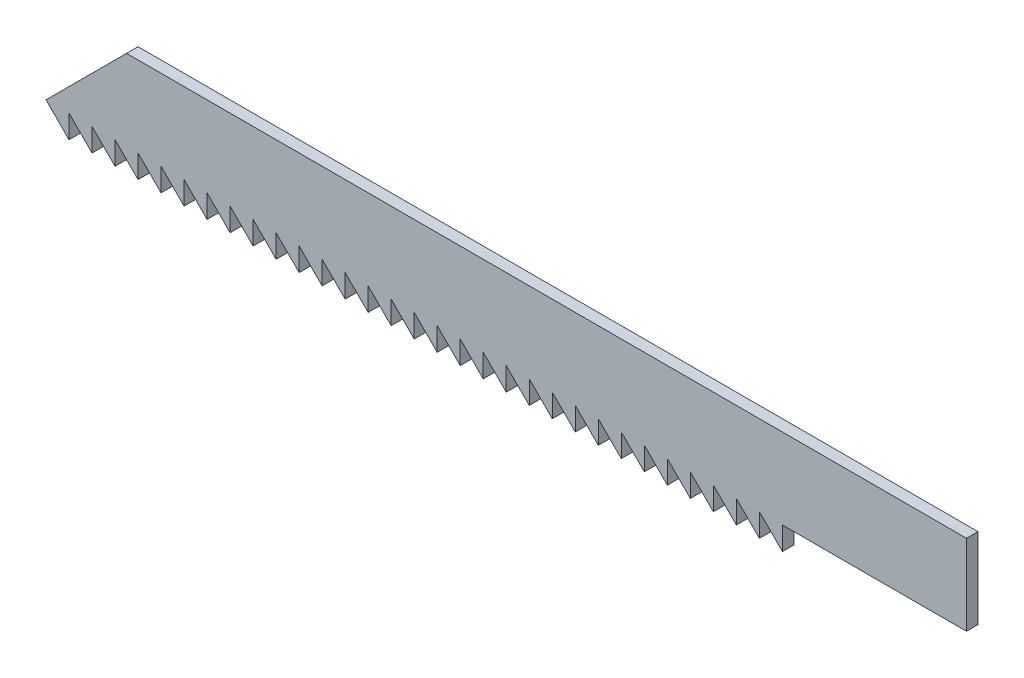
ISO-10303-21;
HEADER;
FILE_DESCRIPTION(('STEP AP214'),'2;1');
FILE_NAME('part.step','',(''),(''),'','','');
FILE_SCHEMA(('AUTOMOTIVE_DESIGN { 1 0 10303 214 1 1 1 1 }'));
ENDSEC;
DATA;
#1=APPLICATION_CONTEXT('core data for automotive mechanical design processes');
#2=APPLICATION_PROTOCOL_DEFINITION('international standard','automotive_design',2000,#1);
#3=PRODUCT_CONTEXT('',#1,'mechanical');
#4=PRODUCT('Part','Part','',(#3));
#5=PRODUCT_RELATED_PRODUCT_CATEGORY('part','',(#4));
#6=PRODUCT_DEFINITION_FORMATION('','',#4);
#7=PRODUCT_DEFINITION_CONTEXT('part definition',#1,'design');
#8=PRODUCT_DEFINITION('design','',#6,#7);
#9=PRODUCT_DEFINITION_SHAPE('','',#8);
#10=(LENGTH_UNIT() NAMED_UNIT(*) SI_UNIT(.MILLI.,.METRE.));
#11=(NAMED_UNIT(*) PLANE_ANGLE_UNIT() SI_UNIT($,.RADIAN.));
#12=(NAMED_UNIT(*) SI_UNIT($,.STERADIAN.) SOLID_ANGLE_UNIT());
#13=UNCERTAINTY_MEASURE_WITH_UNIT(LENGTH_MEASURE(1.E-05),#10,'distance_accuracy_value','');
#14=(GEOMETRIC_REPRESENTATION_CONTEXT(3) GLOBAL_UNCERTAINTY_ASSIGNED_CONTEXT((#13)) GLOBAL_UNIT_ASSIGNED_CONTEXT((#10,
#11,#12)) REPRESENTATION_CONTEXT('',''));
#15=CARTESIAN_POINT('',(0.,0.,0.));
#16=DIRECTION('',(0.,0.,1.));
#17=DIRECTION('',(1.,0.,0.));
#18=AXIS2_PLACEMENT_3D('',#15,#16,#17);
#19=CARTESIAN_POINT('',(-40.,0.,1.));
#20=DIRECTION('',(0.,1.,0.));
#21=DIRECTION('',(0.,0.,1.));
#22=AXIS2_PLACEMENT_3D('',#19,#20,#21);
#23=PLANE('',#22);
#24=DIRECTION('',(1.,0.,0.));
#25=VECTOR('',#24,1.);
#26=CARTESIAN_POINT('',(-40.,0.,1.));
#27=LINE('',#26,#25);
#28=CARTESIAN_POINT('',(24.,0.,1.));
#29=VERTEX_POINT('',#28);
#30=CARTESIAN_POINT('',(40.,0.,1.));
#31=VERTEX_POINT('',#30);
#32=EDGE_CURVE('E34',#29,#31,#27,.T.);
#33=ORIENTED_EDGE('',*,*,#32,.F.);
#34=DIRECTION('',(0.,0.,1.));
#35=VECTOR('',#34,1.);
#36=CARTESIAN_POINT('',(24.,0.,-2.82842712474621));
#37=LINE('',#36,#35);
#38=CARTESIAN_POINT('',(24.,0.,0.));
#39=VERTEX_POINT('',#38);
#40=EDGE_CURVE('E1260',#39,#29,#37,.T.);
#41=ORIENTED_EDGE('',*,*,#40,.F.);
#42=DIRECTION('',(1.,0.,0.));
#43=VECTOR('',#42,1.);
#44=CARTESIAN_POINT('',(-40.,0.,0.));
#45=LINE('',#44,#43);
#46=CARTESIAN_POINT('',(40.,0.,0.));
#47=VERTEX_POINT('',#46);
#48=EDGE_CURVE('E945',#39,#47,#45,.T.);
#49=ORIENTED_EDGE('',*,*,#48,.T.);
#50=DIRECTION('',(0.,0.,-1.));
#51=VECTOR('',#50,1.);
#52=CARTESIAN_POINT('',(40.,0.,1.));
#53=LINE('',#52,#51);
#54=EDGE_CURVE('E11',#31,#47,#53,.T.);
#55=ORIENTED_EDGE('',*,*,#54,.F.);
#56=EDGE_LOOP('',(#33,#41,#49,#55));
#57=FACE_BOUND('',#56,.T.);
#58=ADVANCED_FACE('F31',(#57),#23,.F.);
#59=CARTESIAN_POINT('',(40.,0.,1.));
#60=DIRECTION('',(-1.,0.,0.));
#61=DIRECTION('',(0.,0.,1.));
#62=AXIS2_PLACEMENT_3D('',#59,#60,#61);
#63=PLANE('',#62);
#64=DIRECTION('',(0.,1.,0.));
#65=VECTOR('',#64,1.);
#66=CARTESIAN_POINT('',(40.,0.,0.));
#67=LINE('',#66,#65);
#68=CARTESIAN_POINT('',(40.,7.00000000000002,0.));
#69=VERTEX_POINT('',#68);
#70=EDGE_CURVE('E954',#47,#69,#67,.T.);
#71=ORIENTED_EDGE('',*,*,#70,.T.);
#72=DIRECTION('',(0.,0.,-1.));
#73=VECTOR('',#72,1.);
#74=CARTESIAN_POINT('',(40.,7.00000000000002,1.));
#75=LINE('',#74,#73);
#76=CARTESIAN_POINT('',(40.,7.00000000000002,1.));
#77=VERTEX_POINT('',#76);
#78=EDGE_CURVE('E40',#77,#69,#75,.T.);
#79=ORIENTED_EDGE('',*,*,#78,.F.);
#80=DIRECTION('',(0.,1.,0.));
#81=VECTOR('',#80,1.);
#82=CARTESIAN_POINT('',(40.,0.,1.));
#83=LINE('',#82,#81);
#84=EDGE_CURVE('E963',#31,#77,#83,.T.);
#85=ORIENTED_EDGE('',*,*,#84,.F.);
#86=ORIENTED_EDGE('',*,*,#54,.T.);
#87=EDGE_LOOP('',(#71,#79,#85,#86));
#88=FACE_BOUND('',#87,.T.);
#89=ADVANCED_FACE('F1271',(#88),#63,.F.);
#90=CARTESIAN_POINT('',(-33.,7.00000000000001,1.));
#91=DIRECTION('',(0.,-1.,0.));
#92=DIRECTION('',(1.,0.,0.));
#93=AXIS2_PLACEMENT_3D('',#90,#91,#92);
#94=PLANE('',#93);
#95=DIRECTION('',(-1.,0.,0.));
#96=VECTOR('',#95,1.);
#97=CARTESIAN_POINT('',(-33.,7.00000000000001,0.));
#98=LINE('',#97,#96);
#99=CARTESIAN_POINT('',(-33.,7.00000000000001,0.));
#100=VERTEX_POINT('',#99);
#101=EDGE_CURVE('E958',#69,#100,#98,.T.);
#102=ORIENTED_EDGE('',*,*,#101,.T.);
#103=DIRECTION('',(0.,0.,-1.));
#104=VECTOR('',#103,1.);
#105=CARTESIAN_POINT('',(-33.,7.00000000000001,1.));
#106=LINE('',#105,#104);
#107=CARTESIAN_POINT('',(-33.,7.00000000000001,1.));
#108=VERTEX_POINT('',#107);
#109=EDGE_CURVE('E970',#108,#100,#106,.T.);
#110=ORIENTED_EDGE('',*,*,#109,.F.);
#111=DIRECTION('',(-1.,0.,0.));
#112=VECTOR('',#111,1.);
#113=CARTESIAN_POINT('',(-33.,7.00000000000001,1.));
#114=LINE('',#113,#112);
#115=EDGE_CURVE('E53',#77,#108,#114,.T.);
#116=ORIENTED_EDGE('',*,*,#115,.F.);
#117=ORIENTED_EDGE('',*,*,#78,.T.);
#118=EDGE_LOOP('',(#102,#110,#116,#117));
#119=FACE_BOUND('',#118,.T.);
#120=ADVANCED_FACE('F976',(#119),#94,.F.);
#121=CARTESIAN_POINT('',(-40.,0.,1.));
#122=DIRECTION('',(0.707106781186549,-0.707106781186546,0.));
#123=DIRECTION('',(0.707106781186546,0.707106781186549,0.));
#124=AXIS2_PLACEMENT_3D('',#121,#122,#123);
#125=PLANE('',#124);
#126=DIRECTION('',(-0.707106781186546,-0.707106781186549,0.));
#127=VECTOR('',#126,1.);
#128=CARTESIAN_POINT('',(-40.,0.,0.));
#129=LINE('',#128,#127);
#130=CARTESIAN_POINT('',(-40.,0.,0.));
#131=VERTEX_POINT('',#130);
#132=EDGE_CURVE('E960',#100,#131,#129,.T.);
#133=ORIENTED_EDGE('',*,*,#132,.T.);
#134=DIRECTION('',(0.,0.,-1.));
#135=VECTOR('',#134,1.);
#136=CARTESIAN_POINT('',(-40.,0.,1.));
#137=LINE('',#136,#135);
#138=CARTESIAN_POINT('',(-40.,0.,1.));
#139=VERTEX_POINT('',#138);
#140=EDGE_CURVE('E967',#139,#131,#137,.T.);
#141=ORIENTED_EDGE('',*,*,#140,.F.);
#142=DIRECTION('',(-0.707106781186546,-0.707106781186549,0.));
#143=VECTOR('',#142,1.);
#144=CARTESIAN_POINT('',(-40.,0.,1.));
#145=LINE('',#144,#143);
#146=EDGE_CURVE('E48',#108,#139,#145,.T.);
#147=ORIENTED_EDGE('',*,*,#146,.F.);
#148=ORIENTED_EDGE('',*,*,#109,.T.);
#149=EDGE_LOOP('',(#133,#141,#147,#148));
#150=FACE_BOUND('',#149,.T.);
#151=ADVANCED_FACE('F983',(#150),#125,.F.);
#152=CARTESIAN_POINT('',(40.,0.,1.));
#153=DIRECTION('',(0.,0.,1.));
#154=DIRECTION('',(1.,0.,0.));
#155=AXIS2_PLACEMENT_3D('',#152,#153,#154);
#156=PLANE('',#155);
#157=ORIENTED_EDGE('',*,*,#146,.T.);
#158=DIRECTION('',(0.707106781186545,-0.70710678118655,0.));
#159=VECTOR('',#158,1.);
#160=CARTESIAN_POINT('',(-40.,0.,1.));
#161=LINE('',#160,#159);
#162=CARTESIAN_POINT('',(-38.,-2.00000000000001,1.));
#163=VERTEX_POINT('',#162);
#164=EDGE_CURVE('E924',#139,#163,#161,.T.);
#165=ORIENTED_EDGE('',*,*,#164,.T.);
#166=DIRECTION('',(0.,1.,0.));
#167=VECTOR('',#166,1.);
#168=CARTESIAN_POINT('',(-38.,-2.00000000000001,1.));
#169=LINE('',#168,#167);
#170=CARTESIAN_POINT('',(-38.,0.,1.));
#171=VERTEX_POINT('',#170);
#172=EDGE_CURVE('E931',#163,#171,#169,.T.);
#173=ORIENTED_EDGE('',*,*,#172,.T.);
#174=DIRECTION('',(0.707106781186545,-0.70710678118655,0.));
#175=VECTOR('',#174,1.);
#176=CARTESIAN_POINT('',(-38.,0.,1.));
#177=LINE('',#176,#175);
#178=CARTESIAN_POINT('',(-36.,-2.00000000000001,1.));
#179=VERTEX_POINT('',#178);
#180=EDGE_CURVE('E900',#171,#179,#177,.T.);
#181=ORIENTED_EDGE('',*,*,#180,.T.);
#182=DIRECTION('',(0.,1.,0.));
#183=VECTOR('',#182,1.);
#184=CARTESIAN_POINT('',(-36.,-2.00000000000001,1.));
#185=LINE('',#184,#183);
#186=CARTESIAN_POINT('',(-36.,0.,1.));
#187=VERTEX_POINT('',#186);
#188=EDGE_CURVE('E913',#179,#187,#185,.T.);
#189=ORIENTED_EDGE('',*,*,#188,.T.);
#190=DIRECTION('',(0.707106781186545,-0.70710678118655,0.));
#191=VECTOR('',#190,1.);
#192=CARTESIAN_POINT('',(-36.,0.,1.));
#193=LINE('',#192,#191);
#194=CARTESIAN_POINT('',(-34.,-2.00000000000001,1.));
#195=VERTEX_POINT('',#194);
#196=EDGE_CURVE('E906',#187,#195,#193,.T.);
#197=ORIENTED_EDGE('',*,*,#196,.T.);
#198=DIRECTION('',(0.,1.,0.));
#199=VECTOR('',#198,1.);
#200=CARTESIAN_POINT('',(-34.,-2.00000000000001,1.));
#201=LINE('',#200,#199);
#202=CARTESIAN_POINT('',(-34.,0.,1.));
#203=VERTEX_POINT('',#202);
#204=EDGE_CURVE('E907',#195,#203,#201,.T.);
#205=ORIENTED_EDGE('',*,*,#204,.T.);
#206=DIRECTION('',(0.707106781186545,-0.70710678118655,0.));
#207=VECTOR('',#206,1.);
#208=CARTESIAN_POINT('',(-34.,0.,1.));
#209=LINE('',#208,#207);
#210=CARTESIAN_POINT('',(-32.,-2.00000000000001,1.));
#211=VERTEX_POINT('',#210);
#212=EDGE_CURVE('E891',#203,#211,#209,.T.);
#213=ORIENTED_EDGE('',*,*,#212,.T.);
#214=DIRECTION('',(0.,1.,0.));
#215=VECTOR('',#214,1.);
#216=CARTESIAN_POINT('',(-32.,-2.00000000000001,1.));
#217=LINE('',#216,#215);
#218=CARTESIAN_POINT('',(-32.,0.,1.));
#219=VERTEX_POINT('',#218);
#220=EDGE_CURVE('E892',#211,#219,#217,.T.);
#221=ORIENTED_EDGE('',*,*,#220,.T.);
#222=DIRECTION('',(0.707106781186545,-0.70710678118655,0.));
#223=VECTOR('',#222,1.);
#224=CARTESIAN_POINT('',(-32.,0.,1.));
#225=LINE('',#224,#223);
#226=CARTESIAN_POINT('',(-30.,-2.00000000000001,1.));
#227=VERTEX_POINT('',#226);
#228=EDGE_CURVE('E876',#219,#227,#225,.T.);
#229=ORIENTED_EDGE('',*,*,#228,.T.);
#230=DIRECTION('',(0.,1.,0.));
#231=VECTOR('',#230,1.);
#232=CARTESIAN_POINT('',(-30.,-2.00000000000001,1.));
#233=LINE('',#232,#231);
#234=CARTESIAN_POINT('',(-30.,0.,1.));
#235=VERTEX_POINT('',#234);
#236=EDGE_CURVE('E877',#227,#235,#233,.T.);
#237=ORIENTED_EDGE('',*,*,#236,.T.);
#238=DIRECTION('',(0.707106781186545,-0.70710678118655,0.));
#239=VECTOR('',#238,1.);
#240=CARTESIAN_POINT('',(-30.,0.,1.));
#241=LINE('',#240,#239);
#242=CARTESIAN_POINT('',(-28.,-2.00000000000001,1.));
#243=VERTEX_POINT('',#242);
#244=EDGE_CURVE('E861',#235,#243,#241,.T.);
#245=ORIENTED_EDGE('',*,*,#244,.T.);
#246=DIRECTION('',(0.,1.,0.));
#247=VECTOR('',#246,1.);
#248=CARTESIAN_POINT('',(-28.,-2.00000000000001,1.));
#249=LINE('',#248,#247);
#250=CARTESIAN_POINT('',(-28.,0.,1.));
#251=VERTEX_POINT('',#250);
#252=EDGE_CURVE('E862',#243,#251,#249,.T.);
#253=ORIENTED_EDGE('',*,*,#252,.T.);
#254=DIRECTION('',(0.707106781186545,-0.70710678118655,0.));
#255=VECTOR('',#254,1.);
#256=CARTESIAN_POINT('',(-28.,0.,1.));
#257=LINE('',#256,#255);
#258=CARTESIAN_POINT('',(-26.,-2.00000000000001,1.));
#259=VERTEX_POINT('',#258);
#260=EDGE_CURVE('E846',#251,#259,#257,.T.);
#261=ORIENTED_EDGE('',*,*,#260,.T.);
#262=DIRECTION('',(0.,1.,0.));
#263=VECTOR('',#262,1.);
#264=CARTESIAN_POINT('',(-26.,-2.00000000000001,1.));
#265=LINE('',#264,#263);
#266=CARTESIAN_POINT('',(-26.,0.,1.));
#267=VERTEX_POINT('',#266);
#268=EDGE_CURVE('E847',#259,#267,#265,.T.);
#269=ORIENTED_EDGE('',*,*,#268,.T.);
#270=DIRECTION('',(0.707106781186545,-0.70710678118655,0.));
#271=VECTOR('',#270,1.);
#272=CARTESIAN_POINT('',(-26.,0.,1.));
#273=LINE('',#272,#271);
#274=CARTESIAN_POINT('',(-24.,-2.,1.));
#275=VERTEX_POINT('',#274);
#276=EDGE_CURVE('E831',#267,#275,#273,.T.);
#277=ORIENTED_EDGE('',*,*,#276,.T.);
#278=DIRECTION('',(0.,1.,0.));
#279=VECTOR('',#278,1.);
#280=CARTESIAN_POINT('',(-24.,-2.,1.));
#281=LINE('',#280,#279);
#282=CARTESIAN_POINT('',(-24.,0.,1.));
#283=VERTEX_POINT('',#282);
#284=EDGE_CURVE('E832',#275,#283,#281,.T.);
#285=ORIENTED_EDGE('',*,*,#284,.T.);
#286=DIRECTION('',(0.707106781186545,-0.70710678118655,0.));
#287=VECTOR('',#286,1.);
#288=CARTESIAN_POINT('',(-24.,0.,1.));
#289=LINE('',#288,#287);
#290=CARTESIAN_POINT('',(-22.,-2.,1.));
#291=VERTEX_POINT('',#290);
#292=EDGE_CURVE('E816',#283,#291,#289,.T.);
#293=ORIENTED_EDGE('',*,*,#292,.T.);
#294=DIRECTION('',(0.,1.,0.));
#295=VECTOR('',#294,1.);
#296=CARTESIAN_POINT('',(-22.,-2.,1.));
#297=LINE('',#296,#295);
#298=CARTESIAN_POINT('',(-22.,0.,1.));
#299=VERTEX_POINT('',#298);
#300=EDGE_CURVE('E817',#291,#299,#297,.T.);
#301=ORIENTED_EDGE('',*,*,#300,.T.);
#302=DIRECTION('',(0.707106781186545,-0.70710678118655,0.));
#303=VECTOR('',#302,1.);
#304=CARTESIAN_POINT('',(-22.,0.,1.));
#305=LINE('',#304,#303);
#306=CARTESIAN_POINT('',(-20.,-2.,1.));
#307=VERTEX_POINT('',#306);
#308=EDGE_CURVE('E801',#299,#307,#305,.T.);
#309=ORIENTED_EDGE('',*,*,#308,.T.);
#310=DIRECTION('',(0.,1.,0.));
#311=VECTOR('',#310,1.);
#312=CARTESIAN_POINT('',(-20.,-2.,1.));
#313=LINE('',#312,#311);
#314=CARTESIAN_POINT('',(-20.,0.,1.));
#315=VERTEX_POINT('',#314);
#316=EDGE_CURVE('E802',#307,#315,#313,.T.);
#317=ORIENTED_EDGE('',*,*,#316,.T.);
#318=DIRECTION('',(0.707106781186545,-0.70710678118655,0.));
#319=VECTOR('',#318,1.);
#320=CARTESIAN_POINT('',(-20.,0.,1.));
#321=LINE('',#320,#319);
#322=CARTESIAN_POINT('',(-18.,-2.,1.));
#323=VERTEX_POINT('',#322);
#324=EDGE_CURVE('E786',#315,#323,#321,.T.);
#325=ORIENTED_EDGE('',*,*,#324,.T.);
#326=DIRECTION('',(0.,1.,0.));
#327=VECTOR('',#326,1.);
#328=CARTESIAN_POINT('',(-18.,-2.,1.));
#329=LINE('',#328,#327);
#330=CARTESIAN_POINT('',(-18.,0.,1.));
#331=VERTEX_POINT('',#330);
#332=EDGE_CURVE('E787',#323,#331,#329,.T.);
#333=ORIENTED_EDGE('',*,*,#332,.T.);
#334=DIRECTION('',(0.707106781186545,-0.70710678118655,0.));
#335=VECTOR('',#334,1.);
#336=CARTESIAN_POINT('',(-18.,0.,1.));
#337=LINE('',#336,#335);
#338=CARTESIAN_POINT('',(-16.,-2.,1.));
#339=VERTEX_POINT('',#338);
#340=EDGE_CURVE('E771',#331,#339,#337,.T.);
#341=ORIENTED_EDGE('',*,*,#340,.T.);
#342=DIRECTION('',(0.,1.,0.));
#343=VECTOR('',#342,1.);
#344=CARTESIAN_POINT('',(-16.,-2.,1.));
#345=LINE('',#344,#343);
#346=CARTESIAN_POINT('',(-16.,0.,1.));
#347=VERTEX_POINT('',#346);
#348=EDGE_CURVE('E772',#339,#347,#345,.T.);
#349=ORIENTED_EDGE('',*,*,#348,.T.);
#350=DIRECTION('',(0.707106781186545,-0.70710678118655,0.));
#351=VECTOR('',#350,1.);
#352=CARTESIAN_POINT('',(-16.,0.,1.));
#353=LINE('',#352,#351);
#354=CARTESIAN_POINT('',(-14.,-2.,1.));
#355=VERTEX_POINT('',#354);
#356=EDGE_CURVE('E756',#347,#355,#353,.T.);
#357=ORIENTED_EDGE('',*,*,#356,.T.);
#358=DIRECTION('',(0.,1.,0.));
#359=VECTOR('',#358,1.);
#360=CARTESIAN_POINT('',(-14.,-2.,1.));
#361=LINE('',#360,#359);
#362=CARTESIAN_POINT('',(-14.,0.,1.));
#363=VERTEX_POINT('',#362);
#364=EDGE_CURVE('E757',#355,#363,#361,.T.);
#365=ORIENTED_EDGE('',*,*,#364,.T.);
#366=DIRECTION('',(0.707106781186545,-0.70710678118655,0.));
#367=VECTOR('',#366,1.);
#368=CARTESIAN_POINT('',(-14.,0.,1.));
#369=LINE('',#368,#367);
#370=CARTESIAN_POINT('',(-12.,-2.,1.));
#371=VERTEX_POINT('',#370);
#372=EDGE_CURVE('E741',#363,#371,#369,.T.);
#373=ORIENTED_EDGE('',*,*,#372,.T.);
#374=DIRECTION('',(0.,1.,0.));
#375=VECTOR('',#374,1.);
#376=CARTESIAN_POINT('',(-12.,-2.,1.));
#377=LINE('',#376,#375);
#378=CARTESIAN_POINT('',(-12.,0.,1.));
#379=VERTEX_POINT('',#378);
#380=EDGE_CURVE('E742',#371,#379,#377,.T.);
#381=ORIENTED_EDGE('',*,*,#380,.T.);
#382=DIRECTION('',(0.707106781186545,-0.70710678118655,0.));
#383=VECTOR('',#382,1.);
#384=CARTESIAN_POINT('',(-12.,0.,1.));
#385=LINE('',#384,#383);
#386=CARTESIAN_POINT('',(-9.99999999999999,-2.,1.));
#387=VERTEX_POINT('',#386);
#388=EDGE_CURVE('E726',#379,#387,#385,.T.);
#389=ORIENTED_EDGE('',*,*,#388,.T.);
#390=DIRECTION('',(0.,1.,0.));
#391=VECTOR('',#390,1.);
#392=CARTESIAN_POINT('',(-9.99999999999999,-2.,1.));
#393=LINE('',#392,#391);
#394=CARTESIAN_POINT('',(-10.,0.,1.));
#395=VERTEX_POINT('',#394);
#396=EDGE_CURVE('E727',#387,#395,#393,.T.);
#397=ORIENTED_EDGE('',*,*,#396,.T.);
#398=DIRECTION('',(0.707106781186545,-0.70710678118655,0.));
#399=VECTOR('',#398,1.);
#400=CARTESIAN_POINT('',(-10.,0.,1.));
#401=LINE('',#400,#399);
#402=CARTESIAN_POINT('',(-7.99999999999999,-2.,1.));
#403=VERTEX_POINT('',#402);
#404=EDGE_CURVE('E711',#395,#403,#401,.T.);
#405=ORIENTED_EDGE('',*,*,#404,.T.);
#406=DIRECTION('',(0.,1.,0.));
#407=VECTOR('',#406,1.);
#408=CARTESIAN_POINT('',(-7.99999999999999,-2.,1.));
#409=LINE('',#408,#407);
#410=CARTESIAN_POINT('',(-8.,0.,1.));
#411=VERTEX_POINT('',#410);
#412=EDGE_CURVE('E712',#403,#411,#409,.T.);
#413=ORIENTED_EDGE('',*,*,#412,.T.);
#414=DIRECTION('',(0.707106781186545,-0.70710678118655,0.));
#415=VECTOR('',#414,1.);
#416=CARTESIAN_POINT('',(-8.,0.,1.));
#417=LINE('',#416,#415);
#418=CARTESIAN_POINT('',(-5.99999999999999,-2.,1.));
#419=VERTEX_POINT('',#418);
#420=EDGE_CURVE('E696',#411,#419,#417,.T.);
#421=ORIENTED_EDGE('',*,*,#420,.T.);
#422=DIRECTION('',(0.,1.,0.));
#423=VECTOR('',#422,1.);
#424=CARTESIAN_POINT('',(-5.99999999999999,-2.,1.));
#425=LINE('',#424,#423);
#426=CARTESIAN_POINT('',(-6.,0.,1.));
#427=VERTEX_POINT('',#426);
#428=EDGE_CURVE('E697',#419,#427,#425,.T.);
#429=ORIENTED_EDGE('',*,*,#428,.T.);
#430=DIRECTION('',(0.707106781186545,-0.70710678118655,0.));
#431=VECTOR('',#430,1.);
#432=CARTESIAN_POINT('',(-6.,0.,1.));
#433=LINE('',#432,#431);
#434=CARTESIAN_POINT('',(-3.99999999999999,-2.,1.));
#435=VERTEX_POINT('',#434);
#436=EDGE_CURVE('E681',#427,#435,#433,.T.);
#437=ORIENTED_EDGE('',*,*,#436,.T.);
#438=DIRECTION('',(0.,1.,0.));
#439=VECTOR('',#438,1.);
#440=CARTESIAN_POINT('',(-3.99999999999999,-2.,1.));
#441=LINE('',#440,#439);
#442=CARTESIAN_POINT('',(-4.,0.,1.));
#443=VERTEX_POINT('',#442);
#444=EDGE_CURVE('E682',#435,#443,#441,.T.);
#445=ORIENTED_EDGE('',*,*,#444,.T.);
#446=DIRECTION('',(0.707106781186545,-0.70710678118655,0.));
#447=VECTOR('',#446,1.);
#448=CARTESIAN_POINT('',(-4.,0.,1.));
#449=LINE('',#448,#447);
#450=CARTESIAN_POINT('',(-1.99999999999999,-2.,1.));
#451=VERTEX_POINT('',#450);
#452=EDGE_CURVE('E666',#443,#451,#449,.T.);
#453=ORIENTED_EDGE('',*,*,#452,.T.);
#454=DIRECTION('',(0.,1.,0.));
#455=VECTOR('',#454,1.);
#456=CARTESIAN_POINT('',(-1.99999999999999,-2.,1.));
#457=LINE('',#456,#455);
#458=CARTESIAN_POINT('',(-1.99999999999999,0.,1.));
#459=VERTEX_POINT('',#458);
#460=EDGE_CURVE('E667',#451,#459,#457,.T.);
#461=ORIENTED_EDGE('',*,*,#460,.T.);
#462=DIRECTION('',(0.707106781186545,-0.70710678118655,0.));
#463=VECTOR('',#462,1.);
#464=CARTESIAN_POINT('',(-2.,0.,1.));
#465=LINE('',#464,#463);
#466=CARTESIAN_POINT('',(0.,-2.,1.));
#467=VERTEX_POINT('',#466);
#468=EDGE_CURVE('E651',#459,#467,#465,.T.);
#469=ORIENTED_EDGE('',*,*,#468,.T.);
#470=DIRECTION('',(0.,1.,0.));
#471=VECTOR('',#470,1.);
#472=CARTESIAN_POINT('',(0.,-2.,1.));
#473=LINE('',#472,#471);
#474=CARTESIAN_POINT('',(0.,0.,1.));
#475=VERTEX_POINT('',#474);
#476=EDGE_CURVE('E652',#467,#475,#473,.T.);
#477=ORIENTED_EDGE('',*,*,#476,.T.);
#478=DIRECTION('',(0.707106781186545,-0.70710678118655,0.));
#479=VECTOR('',#478,1.);
#480=CARTESIAN_POINT('',(0.,0.,1.));
#481=LINE('',#480,#479);
#482=CARTESIAN_POINT('',(2.00000000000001,-2.,1.));
#483=VERTEX_POINT('',#482);
#484=EDGE_CURVE('E636',#475,#483,#481,.T.);
#485=ORIENTED_EDGE('',*,*,#484,.T.);
#486=DIRECTION('',(0.,1.,0.));
#487=VECTOR('',#486,1.);
#488=CARTESIAN_POINT('',(2.00000000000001,-2.,1.));
#489=LINE('',#488,#487);
#490=CARTESIAN_POINT('',(2.,0.,1.));
#491=VERTEX_POINT('',#490);
#492=EDGE_CURVE('E637',#483,#491,#489,.T.);
#493=ORIENTED_EDGE('',*,*,#492,.T.);
#494=DIRECTION('',(0.707106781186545,-0.70710678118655,0.));
#495=VECTOR('',#494,1.);
#496=CARTESIAN_POINT('',(2.,0.,1.));
#497=LINE('',#496,#495);
#498=CARTESIAN_POINT('',(4.00000000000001,-2.,1.));
#499=VERTEX_POINT('',#498);
#500=EDGE_CURVE('E621',#491,#499,#497,.T.);
#501=ORIENTED_EDGE('',*,*,#500,.T.);
#502=DIRECTION('',(0.,1.,0.));
#503=VECTOR('',#502,1.);
#504=CARTESIAN_POINT('',(4.00000000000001,-2.,1.));
#505=LINE('',#504,#503);
#506=CARTESIAN_POINT('',(4.,0.,1.));
#507=VERTEX_POINT('',#506);
#508=EDGE_CURVE('E622',#499,#507,#505,.T.);
#509=ORIENTED_EDGE('',*,*,#508,.T.);
#510=DIRECTION('',(0.707106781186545,-0.70710678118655,0.));
#511=VECTOR('',#510,1.);
#512=CARTESIAN_POINT('',(4.,0.,1.));
#513=LINE('',#512,#511);
#514=CARTESIAN_POINT('',(6.00000000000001,-2.,1.));
#515=VERTEX_POINT('',#514);
#516=EDGE_CURVE('E606',#507,#515,#513,.T.);
#517=ORIENTED_EDGE('',*,*,#516,.T.);
#518=DIRECTION('',(0.,1.,0.));
#519=VECTOR('',#518,1.);
#520=CARTESIAN_POINT('',(6.00000000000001,-2.,1.));
#521=LINE('',#520,#519);
#522=CARTESIAN_POINT('',(6.,0.,1.));
#523=VERTEX_POINT('',#522);
#524=EDGE_CURVE('E607',#515,#523,#521,.T.);
#525=ORIENTED_EDGE('',*,*,#524,.T.);
#526=DIRECTION('',(0.707106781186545,-0.70710678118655,0.));
#527=VECTOR('',#526,1.);
#528=CARTESIAN_POINT('',(6.,0.,1.));
#529=LINE('',#528,#527);
#530=CARTESIAN_POINT('',(8.00000000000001,-2.,1.));
#531=VERTEX_POINT('',#530);
#532=EDGE_CURVE('E591',#523,#531,#529,.T.);
#533=ORIENTED_EDGE('',*,*,#532,.T.);
#534=DIRECTION('',(0.,1.,0.));
#535=VECTOR('',#534,1.);
#536=CARTESIAN_POINT('',(8.00000000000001,-2.,1.));
#537=LINE('',#536,#535);
#538=CARTESIAN_POINT('',(8.,0.,1.));
#539=VERTEX_POINT('',#538);
#540=EDGE_CURVE('E592',#531,#539,#537,.T.);
#541=ORIENTED_EDGE('',*,*,#540,.T.);
#542=DIRECTION('',(0.707106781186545,-0.70710678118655,0.));
#543=VECTOR('',#542,1.);
#544=CARTESIAN_POINT('',(8.,0.,1.));
#545=LINE('',#544,#543);
#546=CARTESIAN_POINT('',(10.,-2.,1.));
#547=VERTEX_POINT('',#546);
#548=EDGE_CURVE('E576',#539,#547,#545,.T.);
#549=ORIENTED_EDGE('',*,*,#548,.T.);
#550=DIRECTION('',(0.,1.,0.));
#551=VECTOR('',#550,1.);
#552=CARTESIAN_POINT('',(10.,-2.,1.));
#553=LINE('',#552,#551);
#554=CARTESIAN_POINT('',(10.,0.,1.));
#555=VERTEX_POINT('',#554);
#556=EDGE_CURVE('E577',#547,#555,#553,.T.);
#557=ORIENTED_EDGE('',*,*,#556,.T.);
#558=DIRECTION('',(0.707106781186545,-0.70710678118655,0.));
#559=VECTOR('',#558,1.);
#560=CARTESIAN_POINT('',(10.,0.,1.));
#561=LINE('',#560,#559);
#562=CARTESIAN_POINT('',(12.,-2.,1.));
#563=VERTEX_POINT('',#562);
#564=EDGE_CURVE('E561',#555,#563,#561,.T.);
#565=ORIENTED_EDGE('',*,*,#564,.T.);
#566=DIRECTION('',(0.,1.,0.));
#567=VECTOR('',#566,1.);
#568=CARTESIAN_POINT('',(12.,-2.,1.));
#569=LINE('',#568,#567);
#570=CARTESIAN_POINT('',(12.,0.,1.));
#571=VERTEX_POINT('',#570);
#572=EDGE_CURVE('E562',#563,#571,#569,.T.);
#573=ORIENTED_EDGE('',*,*,#572,.T.);
#574=DIRECTION('',(0.707106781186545,-0.70710678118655,0.));
#575=VECTOR('',#574,1.);
#576=CARTESIAN_POINT('',(12.,0.,1.));
#577=LINE('',#576,#575);
#578=CARTESIAN_POINT('',(14.,-2.,1.));
#579=VERTEX_POINT('',#578);
#580=EDGE_CURVE('E546',#571,#579,#577,.T.);
#581=ORIENTED_EDGE('',*,*,#580,.T.);
#582=DIRECTION('',(0.,1.,0.));
#583=VECTOR('',#582,1.);
#584=CARTESIAN_POINT('',(14.,-2.,1.));
#585=LINE('',#584,#583);
#586=CARTESIAN_POINT('',(14.,0.,1.));
#587=VERTEX_POINT('',#586);
#588=EDGE_CURVE('E547',#579,#587,#585,.T.);
#589=ORIENTED_EDGE('',*,*,#588,.T.);
#590=DIRECTION('',(0.707106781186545,-0.70710678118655,0.));
#591=VECTOR('',#590,1.);
#592=CARTESIAN_POINT('',(14.,0.,1.));
#593=LINE('',#592,#591);
#594=CARTESIAN_POINT('',(16.,-2.,1.));
#595=VERTEX_POINT('',#594);
#596=EDGE_CURVE('E531',#587,#595,#593,.T.);
#597=ORIENTED_EDGE('',*,*,#596,.T.);
#598=DIRECTION('',(0.,1.,0.));
#599=VECTOR('',#598,1.);
#600=CARTESIAN_POINT('',(16.,-2.,1.));
#601=LINE('',#600,#599);
#602=CARTESIAN_POINT('',(16.,0.,1.));
#603=VERTEX_POINT('',#602);
#604=EDGE_CURVE('E532',#595,#603,#601,.T.);
#605=ORIENTED_EDGE('',*,*,#604,.T.);
#606=DIRECTION('',(0.707106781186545,-0.70710678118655,0.));
#607=VECTOR('',#606,1.);
#608=CARTESIAN_POINT('',(16.,0.,1.));
#609=LINE('',#608,#607);
#610=CARTESIAN_POINT('',(18.,-2.,1.));
#611=VERTEX_POINT('',#610);
#612=EDGE_CURVE('E516',#603,#611,#609,.T.);
#613=ORIENTED_EDGE('',*,*,#612,.T.);
#614=DIRECTION('',(0.,1.,0.));
#615=VECTOR('',#614,1.);
#616=CARTESIAN_POINT('',(18.,-2.,1.));
#617=LINE('',#616,#615);
#618=CARTESIAN_POINT('',(18.,0.,1.));
#619=VERTEX_POINT('',#618);
#620=EDGE_CURVE('E517',#611,#619,#617,.T.);
#621=ORIENTED_EDGE('',*,*,#620,.T.);
#622=DIRECTION('',(0.707106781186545,-0.70710678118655,0.));
#623=VECTOR('',#622,1.);
#624=CARTESIAN_POINT('',(18.,0.,1.));
#625=LINE('',#624,#623);
#626=CARTESIAN_POINT('',(20.,-2.,1.));
#627=VERTEX_POINT('',#626);
#628=EDGE_CURVE('E501',#619,#627,#625,.T.);
#629=ORIENTED_EDGE('',*,*,#628,.T.);
#630=DIRECTION('',(0.,1.,0.));
#631=VECTOR('',#630,1.);
#632=CARTESIAN_POINT('',(20.,-2.,1.));
#633=LINE('',#632,#631);
#634=CARTESIAN_POINT('',(20.,0.,1.));
#635=VERTEX_POINT('',#634);
#636=EDGE_CURVE('E502',#627,#635,#633,.T.);
#637=ORIENTED_EDGE('',*,*,#636,.T.);
#638=DIRECTION('',(0.707106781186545,-0.70710678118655,0.));
#639=VECTOR('',#638,1.);
#640=CARTESIAN_POINT('',(20.,0.,1.));
#641=LINE('',#640,#639);
#642=CARTESIAN_POINT('',(22.,-2.,1.));
#643=VERTEX_POINT('',#642);
#644=EDGE_CURVE('E477',#635,#643,#641,.T.);
#645=ORIENTED_EDGE('',*,*,#644,.T.);
#646=DIRECTION('',(0.,1.,0.));
#647=VECTOR('',#646,1.);
#648=CARTESIAN_POINT('',(22.,-2.,1.));
#649=LINE('',#648,#647);
#650=CARTESIAN_POINT('',(22.,0.,1.));
#651=VERTEX_POINT('',#650);
#652=EDGE_CURVE('E487',#643,#651,#649,.T.);
#653=ORIENTED_EDGE('',*,*,#652,.T.);
#654=DIRECTION('',(0.707106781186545,-0.70710678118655,0.));
#655=VECTOR('',#654,1.);
#656=CARTESIAN_POINT('',(22.,0.,1.));
#657=LINE('',#656,#655);
#658=CARTESIAN_POINT('',(24.,-2.,1.));
#659=VERTEX_POINT('',#658);
#660=EDGE_CURVE('E473',#651,#659,#657,.T.);
#661=ORIENTED_EDGE('',*,*,#660,.T.);
#662=DIRECTION('',(0.,1.,0.));
#663=VECTOR('',#662,1.);
#664=CARTESIAN_POINT('',(24.,-2.,1.));
#665=LINE('',#664,#663);
#666=EDGE_CURVE('E467',#659,#29,#665,.T.);
#667=ORIENTED_EDGE('',*,*,#666,.T.);
#668=ORIENTED_EDGE('',*,*,#32,.T.);
#669=ORIENTED_EDGE('',*,*,#84,.T.);
#670=ORIENTED_EDGE('',*,*,#115,.T.);
#671=EDGE_LOOP('',(#157,#165,#173,#181,#189,#197,#205,#213,#221,#229,#237,#245,#253,#261,#269,
#277,#285,#293,#301,#309,#317,#325,#333,#341,#349,#357,#365,#373,#381,#389,#397,#405,#413,#421,
#429,#437,#445,#453,#461,#469,#477,#485,#493,#501,#509,#517,#525,#533,#541,#549,#557,#565,#573,
#581,#589,#597,#605,#613,#621,#629,#637,#645,#653,#661,#667,#668,#669,#670));
#672=FACE_BOUND('',#671,.T.);
#673=ADVANCED_FACE('F989',(#672),#156,.T.);
#674=CARTESIAN_POINT('',(40.,0.,0.));
#675=DIRECTION('',(0.,0.,1.));
#676=DIRECTION('',(1.,0.,0.));
#677=AXIS2_PLACEMENT_3D('',#674,#675,#676);
#678=PLANE('',#677);
#679=ORIENTED_EDGE('',*,*,#48,.F.);
#680=DIRECTION('',(0.,-1.,0.));
#681=VECTOR('',#680,1.);
#682=CARTESIAN_POINT('',(24.,-2.,0.));
#683=LINE('',#682,#681);
#684=CARTESIAN_POINT('',(24.,-2.,0.));
#685=VERTEX_POINT('',#684);
#686=EDGE_CURVE('E464',#39,#685,#683,.T.);
#687=ORIENTED_EDGE('',*,*,#686,.T.);
#688=DIRECTION('',(-0.707106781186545,0.70710678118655,0.));
#689=VECTOR('',#688,1.);
#690=CARTESIAN_POINT('',(22.,0.,0.));
#691=LINE('',#690,#689);
#692=CARTESIAN_POINT('',(22.,0.,0.));
#693=VERTEX_POINT('',#692);
#694=EDGE_CURVE('E457',#685,#693,#691,.T.);
#695=ORIENTED_EDGE('',*,*,#694,.T.);
#696=DIRECTION('',(0.,-1.,0.));
#697=VECTOR('',#696,1.);
#698=CARTESIAN_POINT('',(22.,-2.,0.));
#699=LINE('',#698,#697);
#700=CARTESIAN_POINT('',(22.,-2.,0.));
#701=VERTEX_POINT('',#700);
#702=EDGE_CURVE('E462',#693,#701,#699,.T.);
#703=ORIENTED_EDGE('',*,*,#702,.T.);
#704=DIRECTION('',(-0.707106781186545,0.70710678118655,0.));
#705=VECTOR('',#704,1.);
#706=CARTESIAN_POINT('',(20.,0.,0.));
#707=LINE('',#706,#705);
#708=CARTESIAN_POINT('',(20.,0.,0.));
#709=VERTEX_POINT('',#708);
#710=EDGE_CURVE('E483',#701,#709,#707,.T.);
#711=ORIENTED_EDGE('',*,*,#710,.T.);
#712=DIRECTION('',(0.,-1.,0.));
#713=VECTOR('',#712,1.);
#714=CARTESIAN_POINT('',(20.,-2.,0.));
#715=LINE('',#714,#713);
#716=CARTESIAN_POINT('',(20.,-2.,0.));
#717=VERTEX_POINT('',#716);
#718=EDGE_CURVE('E495',#709,#717,#715,.T.);
#719=ORIENTED_EDGE('',*,*,#718,.T.);
#720=DIRECTION('',(-0.707106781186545,0.70710678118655,0.));
#721=VECTOR('',#720,1.);
#722=CARTESIAN_POINT('',(18.,0.,0.));
#723=LINE('',#722,#721);
#724=CARTESIAN_POINT('',(18.,0.,0.));
#725=VERTEX_POINT('',#724);
#726=EDGE_CURVE('E497',#717,#725,#723,.T.);
#727=ORIENTED_EDGE('',*,*,#726,.T.);
#728=DIRECTION('',(0.,-1.,0.));
#729=VECTOR('',#728,1.);
#730=CARTESIAN_POINT('',(18.,-2.,0.));
#731=LINE('',#730,#729);
#732=CARTESIAN_POINT('',(18.,-2.,0.));
#733=VERTEX_POINT('',#732);
#734=EDGE_CURVE('E508',#725,#733,#731,.T.);
#735=ORIENTED_EDGE('',*,*,#734,.T.);
#736=DIRECTION('',(-0.707106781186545,0.70710678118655,0.));
#737=VECTOR('',#736,1.);
#738=CARTESIAN_POINT('',(16.,0.,0.));
#739=LINE('',#738,#737);
#740=CARTESIAN_POINT('',(16.,0.,0.));
#741=VERTEX_POINT('',#740);
#742=EDGE_CURVE('E511',#733,#741,#739,.T.);
#743=ORIENTED_EDGE('',*,*,#742,.T.);
#744=DIRECTION('',(0.,-1.,0.));
#745=VECTOR('',#744,1.);
#746=CARTESIAN_POINT('',(16.,-2.,0.));
#747=LINE('',#746,#745);
#748=CARTESIAN_POINT('',(16.,-2.,0.));
#749=VERTEX_POINT('',#748);
#750=EDGE_CURVE('E523',#741,#749,#747,.T.);
#751=ORIENTED_EDGE('',*,*,#750,.T.);
#752=DIRECTION('',(-0.707106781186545,0.70710678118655,0.));
#753=VECTOR('',#752,1.);
#754=CARTESIAN_POINT('',(14.,0.,0.));
#755=LINE('',#754,#753);
#756=CARTESIAN_POINT('',(14.,0.,0.));
#757=VERTEX_POINT('',#756);
#758=EDGE_CURVE('E526',#749,#757,#755,.T.);
#759=ORIENTED_EDGE('',*,*,#758,.T.);
#760=DIRECTION('',(0.,-1.,0.));
#761=VECTOR('',#760,1.);
#762=CARTESIAN_POINT('',(14.,-2.,0.));
#763=LINE('',#762,#761);
#764=CARTESIAN_POINT('',(14.,-2.,0.));
#765=VERTEX_POINT('',#764);
#766=EDGE_CURVE('E538',#757,#765,#763,.T.);
#767=ORIENTED_EDGE('',*,*,#766,.T.);
#768=DIRECTION('',(-0.707106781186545,0.70710678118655,0.));
#769=VECTOR('',#768,1.);
#770=CARTESIAN_POINT('',(12.,0.,0.));
#771=LINE('',#770,#769);
#772=CARTESIAN_POINT('',(12.,0.,0.));
#773=VERTEX_POINT('',#772);
#774=EDGE_CURVE('E541',#765,#773,#771,.T.);
#775=ORIENTED_EDGE('',*,*,#774,.T.);
#776=DIRECTION('',(0.,-1.,0.));
#777=VECTOR('',#776,1.);
#778=CARTESIAN_POINT('',(12.,-2.,0.));
#779=LINE('',#778,#777);
#780=CARTESIAN_POINT('',(12.,-2.,0.));
#781=VERTEX_POINT('',#780);
#782=EDGE_CURVE('E553',#773,#781,#779,.T.);
#783=ORIENTED_EDGE('',*,*,#782,.T.);
#784=DIRECTION('',(-0.707106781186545,0.70710678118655,0.));
#785=VECTOR('',#784,1.);
#786=CARTESIAN_POINT('',(10.,0.,0.));
#787=LINE('',#786,#785);
#788=CARTESIAN_POINT('',(10.,0.,0.));
#789=VERTEX_POINT('',#788);
#790=EDGE_CURVE('E556',#781,#789,#787,.T.);
#791=ORIENTED_EDGE('',*,*,#790,.T.);
#792=DIRECTION('',(0.,-1.,0.));
#793=VECTOR('',#792,1.);
#794=CARTESIAN_POINT('',(10.,-2.,0.));
#795=LINE('',#794,#793);
#796=CARTESIAN_POINT('',(10.,-2.,0.));
#797=VERTEX_POINT('',#796);
#798=EDGE_CURVE('E568',#789,#797,#795,.T.);
#799=ORIENTED_EDGE('',*,*,#798,.T.);
#800=DIRECTION('',(-0.707106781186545,0.70710678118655,0.));
#801=VECTOR('',#800,1.);
#802=CARTESIAN_POINT('',(8.,0.,0.));
#803=LINE('',#802,#801);
#804=CARTESIAN_POINT('',(8.,0.,0.));
#805=VERTEX_POINT('',#804);
#806=EDGE_CURVE('E571',#797,#805,#803,.T.);
#807=ORIENTED_EDGE('',*,*,#806,.T.);
#808=DIRECTION('',(0.,-1.,0.));
#809=VECTOR('',#808,1.);
#810=CARTESIAN_POINT('',(8.00000000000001,-2.,0.));
#811=LINE('',#810,#809);
#812=CARTESIAN_POINT('',(8.00000000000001,-2.,0.));
#813=VERTEX_POINT('',#812);
#814=EDGE_CURVE('E583',#805,#813,#811,.T.);
#815=ORIENTED_EDGE('',*,*,#814,.T.);
#816=DIRECTION('',(-0.707106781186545,0.70710678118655,0.));
#817=VECTOR('',#816,1.);
#818=CARTESIAN_POINT('',(6.,0.,0.));
#819=LINE('',#818,#817);
#820=CARTESIAN_POINT('',(6.,0.,0.));
#821=VERTEX_POINT('',#820);
#822=EDGE_CURVE('E586',#813,#821,#819,.T.);
#823=ORIENTED_EDGE('',*,*,#822,.T.);
#824=DIRECTION('',(0.,-1.,0.));
#825=VECTOR('',#824,1.);
#826=CARTESIAN_POINT('',(6.00000000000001,-2.,0.));
#827=LINE('',#826,#825);
#828=CARTESIAN_POINT('',(6.00000000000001,-2.,0.));
#829=VERTEX_POINT('',#828);
#830=EDGE_CURVE('E598',#821,#829,#827,.T.);
#831=ORIENTED_EDGE('',*,*,#830,.T.);
#832=DIRECTION('',(-0.707106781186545,0.70710678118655,0.));
#833=VECTOR('',#832,1.);
#834=CARTESIAN_POINT('',(4.,0.,0.));
#835=LINE('',#834,#833);
#836=CARTESIAN_POINT('',(4.,0.,0.));
#837=VERTEX_POINT('',#836);
#838=EDGE_CURVE('E601',#829,#837,#835,.T.);
#839=ORIENTED_EDGE('',*,*,#838,.T.);
#840=DIRECTION('',(0.,-1.,0.));
#841=VECTOR('',#840,1.);
#842=CARTESIAN_POINT('',(4.00000000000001,-2.,0.));
#843=LINE('',#842,#841);
#844=CARTESIAN_POINT('',(4.00000000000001,-2.,0.));
#845=VERTEX_POINT('',#844);
#846=EDGE_CURVE('E613',#837,#845,#843,.T.);
#847=ORIENTED_EDGE('',*,*,#846,.T.);
#848=DIRECTION('',(-0.707106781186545,0.70710678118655,0.));
#849=VECTOR('',#848,1.);
#850=CARTESIAN_POINT('',(2.,0.,0.));
#851=LINE('',#850,#849);
#852=CARTESIAN_POINT('',(2.,0.,0.));
#853=VERTEX_POINT('',#852);
#854=EDGE_CURVE('E616',#845,#853,#851,.T.);
#855=ORIENTED_EDGE('',*,*,#854,.T.);
#856=DIRECTION('',(0.,-1.,0.));
#857=VECTOR('',#856,1.);
#858=CARTESIAN_POINT('',(2.00000000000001,-2.,0.));
#859=LINE('',#858,#857);
#860=CARTESIAN_POINT('',(2.00000000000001,-2.,0.));
#861=VERTEX_POINT('',#860);
#862=EDGE_CURVE('E628',#853,#861,#859,.T.);
#863=ORIENTED_EDGE('',*,*,#862,.T.);
#864=DIRECTION('',(-0.707106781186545,0.70710678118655,0.));
#865=VECTOR('',#864,1.);
#866=CARTESIAN_POINT('',(0.,0.,0.));
#867=LINE('',#866,#865);
#868=CARTESIAN_POINT('',(0.,0.,0.));
#869=VERTEX_POINT('',#868);
#870=EDGE_CURVE('E631',#861,#869,#867,.T.);
#871=ORIENTED_EDGE('',*,*,#870,.T.);
#872=DIRECTION('',(0.,-1.,0.));
#873=VECTOR('',#872,1.);
#874=CARTESIAN_POINT('',(0.,-2.,0.));
#875=LINE('',#874,#873);
#876=CARTESIAN_POINT('',(0.,-2.,0.));
#877=VERTEX_POINT('',#876);
#878=EDGE_CURVE('E643',#869,#877,#875,.T.);
#879=ORIENTED_EDGE('',*,*,#878,.T.);
#880=DIRECTION('',(-0.707106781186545,0.70710678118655,0.));
#881=VECTOR('',#880,1.);
#882=CARTESIAN_POINT('',(-2.,0.,0.));
#883=LINE('',#882,#881);
#884=CARTESIAN_POINT('',(-2.,0.,0.));
#885=VERTEX_POINT('',#884);
#886=EDGE_CURVE('E646',#877,#885,#883,.T.);
#887=ORIENTED_EDGE('',*,*,#886,.T.);
#888=DIRECTION('',(0.,-1.,0.));
#889=VECTOR('',#888,1.);
#890=CARTESIAN_POINT('',(-1.99999999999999,-2.,0.));
#891=LINE('',#890,#889);
#892=CARTESIAN_POINT('',(-1.99999999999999,-2.,0.));
#893=VERTEX_POINT('',#892);
#894=EDGE_CURVE('E658',#885,#893,#891,.T.);
#895=ORIENTED_EDGE('',*,*,#894,.T.);
#896=DIRECTION('',(-0.707106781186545,0.70710678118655,0.));
#897=VECTOR('',#896,1.);
#898=CARTESIAN_POINT('',(-4.,0.,0.));
#899=LINE('',#898,#897);
#900=CARTESIAN_POINT('',(-4.,0.,0.));
#901=VERTEX_POINT('',#900);
#902=EDGE_CURVE('E661',#893,#901,#899,.T.);
#903=ORIENTED_EDGE('',*,*,#902,.T.);
#904=DIRECTION('',(0.,-1.,0.));
#905=VECTOR('',#904,1.);
#906=CARTESIAN_POINT('',(-3.99999999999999,-2.,0.));
#907=LINE('',#906,#905);
#908=CARTESIAN_POINT('',(-3.99999999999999,-2.,0.));
#909=VERTEX_POINT('',#908);
#910=EDGE_CURVE('E673',#901,#909,#907,.T.);
#911=ORIENTED_EDGE('',*,*,#910,.T.);
#912=DIRECTION('',(-0.707106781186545,0.70710678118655,0.));
#913=VECTOR('',#912,1.);
#914=CARTESIAN_POINT('',(-6.,0.,0.));
#915=LINE('',#914,#913);
#916=CARTESIAN_POINT('',(-6.,0.,0.));
#917=VERTEX_POINT('',#916);
#918=EDGE_CURVE('E676',#909,#917,#915,.T.);
#919=ORIENTED_EDGE('',*,*,#918,.T.);
#920=DIRECTION('',(0.,-1.,0.));
#921=VECTOR('',#920,1.);
#922=CARTESIAN_POINT('',(-5.99999999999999,-2.,0.));
#923=LINE('',#922,#921);
#924=CARTESIAN_POINT('',(-5.99999999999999,-2.,0.));
#925=VERTEX_POINT('',#924);
#926=EDGE_CURVE('E688',#917,#925,#923,.T.);
#927=ORIENTED_EDGE('',*,*,#926,.T.);
#928=DIRECTION('',(-0.707106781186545,0.70710678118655,0.));
#929=VECTOR('',#928,1.);
#930=CARTESIAN_POINT('',(-8.,0.,0.));
#931=LINE('',#930,#929);
#932=CARTESIAN_POINT('',(-8.,0.,0.));
#933=VERTEX_POINT('',#932);
#934=EDGE_CURVE('E691',#925,#933,#931,.T.);
#935=ORIENTED_EDGE('',*,*,#934,.T.);
#936=DIRECTION('',(0.,-1.,0.));
#937=VECTOR('',#936,1.);
#938=CARTESIAN_POINT('',(-7.99999999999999,-2.,0.));
#939=LINE('',#938,#937);
#940=CARTESIAN_POINT('',(-7.99999999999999,-2.,0.));
#941=VERTEX_POINT('',#940);
#942=EDGE_CURVE('E703',#933,#941,#939,.T.);
#943=ORIENTED_EDGE('',*,*,#942,.T.);
#944=DIRECTION('',(-0.707106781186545,0.70710678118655,0.));
#945=VECTOR('',#944,1.);
#946=CARTESIAN_POINT('',(-10.,0.,0.));
#947=LINE('',#946,#945);
#948=CARTESIAN_POINT('',(-10.,0.,0.));
#949=VERTEX_POINT('',#948);
#950=EDGE_CURVE('E706',#941,#949,#947,.T.);
#951=ORIENTED_EDGE('',*,*,#950,.T.);
#952=DIRECTION('',(0.,-1.,0.));
#953=VECTOR('',#952,1.);
#954=CARTESIAN_POINT('',(-9.99999999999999,-2.,0.));
#955=LINE('',#954,#953);
#956=CARTESIAN_POINT('',(-9.99999999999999,-2.,0.));
#957=VERTEX_POINT('',#956);
#958=EDGE_CURVE('E718',#949,#957,#955,.T.);
#959=ORIENTED_EDGE('',*,*,#958,.T.);
#960=DIRECTION('',(-0.707106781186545,0.70710678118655,0.));
#961=VECTOR('',#960,1.);
#962=CARTESIAN_POINT('',(-12.,0.,0.));
#963=LINE('',#962,#961);
#964=CARTESIAN_POINT('',(-12.,0.,0.));
#965=VERTEX_POINT('',#964);
#966=EDGE_CURVE('E721',#957,#965,#963,.T.);
#967=ORIENTED_EDGE('',*,*,#966,.T.);
#968=DIRECTION('',(0.,-1.,0.));
#969=VECTOR('',#968,1.);
#970=CARTESIAN_POINT('',(-12.,-2.,0.));
#971=LINE('',#970,#969);
#972=CARTESIAN_POINT('',(-12.,-2.,0.));
#973=VERTEX_POINT('',#972);
#974=EDGE_CURVE('E733',#965,#973,#971,.T.);
#975=ORIENTED_EDGE('',*,*,#974,.T.);
#976=DIRECTION('',(-0.707106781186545,0.70710678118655,0.));
#977=VECTOR('',#976,1.);
#978=CARTESIAN_POINT('',(-14.,0.,0.));
#979=LINE('',#978,#977);
#980=CARTESIAN_POINT('',(-14.,0.,0.));
#981=VERTEX_POINT('',#980);
#982=EDGE_CURVE('E736',#973,#981,#979,.T.);
#983=ORIENTED_EDGE('',*,*,#982,.T.);
#984=DIRECTION('',(0.,-1.,0.));
#985=VECTOR('',#984,1.);
#986=CARTESIAN_POINT('',(-14.,-2.,0.));
#987=LINE('',#986,#985);
#988=CARTESIAN_POINT('',(-14.,-2.,0.));
#989=VERTEX_POINT('',#988);
#990=EDGE_CURVE('E748',#981,#989,#987,.T.);
#991=ORIENTED_EDGE('',*,*,#990,.T.);
#992=DIRECTION('',(-0.707106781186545,0.70710678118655,0.));
#993=VECTOR('',#992,1.);
#994=CARTESIAN_POINT('',(-16.,0.,0.));
#995=LINE('',#994,#993);
#996=CARTESIAN_POINT('',(-16.,0.,0.));
#997=VERTEX_POINT('',#996);
#998=EDGE_CURVE('E751',#989,#997,#995,.T.);
#999=ORIENTED_EDGE('',*,*,#998,.T.);
#1000=DIRECTION('',(0.,-1.,0.));
#1001=VECTOR('',#1000,1.);
#1002=CARTESIAN_POINT('',(-16.,-2.,0.));
#1003=LINE('',#1002,#1001);
#1004=CARTESIAN_POINT('',(-16.,-2.,0.));
#1005=VERTEX_POINT('',#1004);
#1006=EDGE_CURVE('E763',#997,#1005,#1003,.T.);
#1007=ORIENTED_EDGE('',*,*,#1006,.T.);
#1008=DIRECTION('',(-0.707106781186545,0.70710678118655,0.));
#1009=VECTOR('',#1008,1.);
#1010=CARTESIAN_POINT('',(-18.,0.,0.));
#1011=LINE('',#1010,#1009);
#1012=CARTESIAN_POINT('',(-18.,0.,0.));
#1013=VERTEX_POINT('',#1012);
#1014=EDGE_CURVE('E766',#1005,#1013,#1011,.T.);
#1015=ORIENTED_EDGE('',*,*,#1014,.T.);
#1016=DIRECTION('',(0.,-1.,0.));
#1017=VECTOR('',#1016,1.);
#1018=CARTESIAN_POINT('',(-18.,-2.,0.));
#1019=LINE('',#1018,#1017);
#1020=CARTESIAN_POINT('',(-18.,-2.,0.));
#1021=VERTEX_POINT('',#1020);
#1022=EDGE_CURVE('E778',#1013,#1021,#1019,.T.);
#1023=ORIENTED_EDGE('',*,*,#1022,.T.);
#1024=DIRECTION('',(-0.707106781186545,0.70710678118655,0.));
#1025=VECTOR('',#1024,1.);
#1026=CARTESIAN_POINT('',(-20.,0.,0.));
#1027=LINE('',#1026,#1025);
#1028=CARTESIAN_POINT('',(-20.,0.,0.));
#1029=VERTEX_POINT('',#1028);
#1030=EDGE_CURVE('E781',#1021,#1029,#1027,.T.);
#1031=ORIENTED_EDGE('',*,*,#1030,.T.);
#1032=DIRECTION('',(0.,-1.,0.));
#1033=VECTOR('',#1032,1.);
#1034=CARTESIAN_POINT('',(-20.,-2.,0.));
#1035=LINE('',#1034,#1033);
#1036=CARTESIAN_POINT('',(-20.,-2.,0.));
#1037=VERTEX_POINT('',#1036);
#1038=EDGE_CURVE('E793',#1029,#1037,#1035,.T.);
#1039=ORIENTED_EDGE('',*,*,#1038,.T.);
#1040=DIRECTION('',(-0.707106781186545,0.70710678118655,0.));
#1041=VECTOR('',#1040,1.);
#1042=CARTESIAN_POINT('',(-22.,0.,0.));
#1043=LINE('',#1042,#1041);
#1044=CARTESIAN_POINT('',(-22.,0.,0.));
#1045=VERTEX_POINT('',#1044);
#1046=EDGE_CURVE('E796',#1037,#1045,#1043,.T.);
#1047=ORIENTED_EDGE('',*,*,#1046,.T.);
#1048=DIRECTION('',(0.,-1.,0.));
#1049=VECTOR('',#1048,1.);
#1050=CARTESIAN_POINT('',(-22.,-2.,0.));
#1051=LINE('',#1050,#1049);
#1052=CARTESIAN_POINT('',(-22.,-2.,0.));
#1053=VERTEX_POINT('',#1052);
#1054=EDGE_CURVE('E808',#1045,#1053,#1051,.T.);
#1055=ORIENTED_EDGE('',*,*,#1054,.T.);
#1056=DIRECTION('',(-0.707106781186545,0.70710678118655,0.));
#1057=VECTOR('',#1056,1.);
#1058=CARTESIAN_POINT('',(-24.,0.,0.));
#1059=LINE('',#1058,#1057);
#1060=CARTESIAN_POINT('',(-24.,0.,0.));
#1061=VERTEX_POINT('',#1060);
#1062=EDGE_CURVE('E811',#1053,#1061,#1059,.T.);
#1063=ORIENTED_EDGE('',*,*,#1062,.T.);
#1064=DIRECTION('',(0.,-1.,0.));
#1065=VECTOR('',#1064,1.);
#1066=CARTESIAN_POINT('',(-24.,-2.,0.));
#1067=LINE('',#1066,#1065);
#1068=CARTESIAN_POINT('',(-24.,-2.,0.));
#1069=VERTEX_POINT('',#1068);
#1070=EDGE_CURVE('E823',#1061,#1069,#1067,.T.);
#1071=ORIENTED_EDGE('',*,*,#1070,.T.);
#1072=DIRECTION('',(-0.707106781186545,0.70710678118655,0.));
#1073=VECTOR('',#1072,1.);
#1074=CARTESIAN_POINT('',(-26.,0.,0.));
#1075=LINE('',#1074,#1073);
#1076=CARTESIAN_POINT('',(-26.,0.,0.));
#1077=VERTEX_POINT('',#1076);
#1078=EDGE_CURVE('E826',#1069,#1077,#1075,.T.);
#1079=ORIENTED_EDGE('',*,*,#1078,.T.);
#1080=DIRECTION('',(0.,-1.,0.));
#1081=VECTOR('',#1080,1.);
#1082=CARTESIAN_POINT('',(-26.,-2.00000000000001,0.));
#1083=LINE('',#1082,#1081);
#1084=CARTESIAN_POINT('',(-26.,-2.00000000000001,0.));
#1085=VERTEX_POINT('',#1084);
#1086=EDGE_CURVE('E838',#1077,#1085,#1083,.T.);
#1087=ORIENTED_EDGE('',*,*,#1086,.T.);
#1088=DIRECTION('',(-0.707106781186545,0.70710678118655,0.));
#1089=VECTOR('',#1088,1.);
#1090=CARTESIAN_POINT('',(-28.,0.,0.));
#1091=LINE('',#1090,#1089);
#1092=CARTESIAN_POINT('',(-28.,0.,0.));
#1093=VERTEX_POINT('',#1092);
#1094=EDGE_CURVE('E841',#1085,#1093,#1091,.T.);
#1095=ORIENTED_EDGE('',*,*,#1094,.T.);
#1096=DIRECTION('',(0.,-1.,0.));
#1097=VECTOR('',#1096,1.);
#1098=CARTESIAN_POINT('',(-28.,-2.00000000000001,0.));
#1099=LINE('',#1098,#1097);
#1100=CARTESIAN_POINT('',(-28.,-2.00000000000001,0.));
#1101=VERTEX_POINT('',#1100);
#1102=EDGE_CURVE('E853',#1093,#1101,#1099,.T.);
#1103=ORIENTED_EDGE('',*,*,#1102,.T.);
#1104=DIRECTION('',(-0.707106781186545,0.70710678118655,0.));
#1105=VECTOR('',#1104,1.);
#1106=CARTESIAN_POINT('',(-30.,0.,0.));
#1107=LINE('',#1106,#1105);
#1108=CARTESIAN_POINT('',(-30.,0.,0.));
#1109=VERTEX_POINT('',#1108);
#1110=EDGE_CURVE('E856',#1101,#1109,#1107,.T.);
#1111=ORIENTED_EDGE('',*,*,#1110,.T.);
#1112=DIRECTION('',(0.,-1.,0.));
#1113=VECTOR('',#1112,1.);
#1114=CARTESIAN_POINT('',(-30.,-2.00000000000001,0.));
#1115=LINE('',#1114,#1113);
#1116=CARTESIAN_POINT('',(-30.,-2.00000000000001,0.));
#1117=VERTEX_POINT('',#1116);
#1118=EDGE_CURVE('E868',#1109,#1117,#1115,.T.);
#1119=ORIENTED_EDGE('',*,*,#1118,.T.);
#1120=DIRECTION('',(-0.707106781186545,0.70710678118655,0.));
#1121=VECTOR('',#1120,1.);
#1122=CARTESIAN_POINT('',(-32.,0.,0.));
#1123=LINE('',#1122,#1121);
#1124=CARTESIAN_POINT('',(-32.,0.,0.));
#1125=VERTEX_POINT('',#1124);
#1126=EDGE_CURVE('E871',#1117,#1125,#1123,.T.);
#1127=ORIENTED_EDGE('',*,*,#1126,.T.);
#1128=DIRECTION('',(0.,-1.,0.));
#1129=VECTOR('',#1128,1.);
#1130=CARTESIAN_POINT('',(-32.,-2.00000000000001,0.));
#1131=LINE('',#1130,#1129);
#1132=CARTESIAN_POINT('',(-32.,-2.00000000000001,0.));
#1133=VERTEX_POINT('',#1132);
#1134=EDGE_CURVE('E883',#1125,#1133,#1131,.T.);
#1135=ORIENTED_EDGE('',*,*,#1134,.T.);
#1136=DIRECTION('',(-0.707106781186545,0.70710678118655,0.));
#1137=VECTOR('',#1136,1.);
#1138=CARTESIAN_POINT('',(-34.,0.,0.));
#1139=LINE('',#1138,#1137);
#1140=CARTESIAN_POINT('',(-34.,0.,0.));
#1141=VERTEX_POINT('',#1140);
#1142=EDGE_CURVE('E886',#1133,#1141,#1139,.T.);
#1143=ORIENTED_EDGE('',*,*,#1142,.T.);
#1144=DIRECTION('',(0.,-1.,0.));
#1145=VECTOR('',#1144,1.);
#1146=CARTESIAN_POINT('',(-34.,-2.00000000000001,0.));
#1147=LINE('',#1146,#1145);
#1148=CARTESIAN_POINT('',(-34.,-2.00000000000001,0.));
#1149=VERTEX_POINT('',#1148);
#1150=EDGE_CURVE('E898',#1141,#1149,#1147,.T.);
#1151=ORIENTED_EDGE('',*,*,#1150,.T.);
#1152=DIRECTION('',(-0.707106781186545,0.70710678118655,0.));
#1153=VECTOR('',#1152,1.);
#1154=CARTESIAN_POINT('',(-36.,0.,0.));
#1155=LINE('',#1154,#1153);
#1156=CARTESIAN_POINT('',(-36.,0.,0.));
#1157=VERTEX_POINT('',#1156);
#1158=EDGE_CURVE('E901',#1149,#1157,#1155,.T.);
#1159=ORIENTED_EDGE('',*,*,#1158,.T.);
#1160=DIRECTION('',(0.,-1.,0.));
#1161=VECTOR('',#1160,1.);
#1162=CARTESIAN_POINT('',(-36.,-2.00000000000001,0.));
#1163=LINE('',#1162,#1161);
#1164=CARTESIAN_POINT('',(-36.,-2.00000000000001,0.));
#1165=VERTEX_POINT('',#1164);
#1166=EDGE_CURVE('E922',#1157,#1165,#1163,.T.);
#1167=ORIENTED_EDGE('',*,*,#1166,.T.);
#1168=DIRECTION('',(-0.707106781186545,0.70710678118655,0.));
#1169=VECTOR('',#1168,1.);
#1170=CARTESIAN_POINT('',(-38.,0.,0.));
#1171=LINE('',#1170,#1169);
#1172=CARTESIAN_POINT('',(-38.,0.,0.));
#1173=VERTEX_POINT('',#1172);
#1174=EDGE_CURVE('E920',#1165,#1173,#1171,.T.);
#1175=ORIENTED_EDGE('',*,*,#1174,.T.);
#1176=DIRECTION('',(0.,-1.,0.));
#1177=VECTOR('',#1176,1.);
#1178=CARTESIAN_POINT('',(-38.,-2.00000000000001,0.));
#1179=LINE('',#1178,#1177);
#1180=CARTESIAN_POINT('',(-38.,-2.00000000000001,0.));
#1181=VERTEX_POINT('',#1180);
#1182=EDGE_CURVE('E928',#1173,#1181,#1179,.T.);
#1183=ORIENTED_EDGE('',*,*,#1182,.T.);
#1184=DIRECTION('',(-0.707106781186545,0.70710678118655,0.));
#1185=VECTOR('',#1184,1.);
#1186=CARTESIAN_POINT('',(-40.,0.,0.));
#1187=LINE('',#1186,#1185);
#1188=EDGE_CURVE('E925',#1181,#131,#1187,.T.);
#1189=ORIENTED_EDGE('',*,*,#1188,.T.);
#1190=ORIENTED_EDGE('',*,*,#132,.F.);
#1191=ORIENTED_EDGE('',*,*,#101,.F.);
#1192=ORIENTED_EDGE('',*,*,#70,.F.);
#1193=EDGE_LOOP('',(#679,#687,#695,#703,#711,#719,#727,#735,#743,#751,#759,#767,#775,#783,#791,
#799,#807,#815,#823,#831,#839,#847,#855,#863,#871,#879,#887,#895,#903,#911,#919,#927,#935,#943,
#951,#959,#967,#975,#983,#991,#999,#1007,#1015,#1023,#1031,#1039,#1047,#1055,#1063,#1071,#1079,
#1087,#1095,#1103,#1111,#1119,#1127,#1135,#1143,#1151,#1159,#1167,#1175,#1183,#1189,#1190,#1191,#1192));
#1194=FACE_BOUND('',#1193,.T.);
#1195=ADVANCED_FACE('F460',(#1194),#678,.F.);
#1196=CARTESIAN_POINT('',(-40.,0.,-2.82842712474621));
#1197=DIRECTION('',(-0.70710678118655,-0.707106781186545,0.));
#1198=DIRECTION('',(0.707106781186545,-0.70710678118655,0.));
#1199=AXIS2_PLACEMENT_3D('',#1196,#1197,#1198);
#1200=PLANE('',#1199);
#1201=ORIENTED_EDGE('',*,*,#1188,.F.);
#1202=DIRECTION('',(0.,0.,1.));
#1203=VECTOR('',#1202,1.);
#1204=CARTESIAN_POINT('',(-38.,-2.00000000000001,-2.82842712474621));
#1205=LINE('',#1204,#1203);
#1206=EDGE_CURVE('E934',#1181,#163,#1205,.T.);
#1207=ORIENTED_EDGE('',*,*,#1206,.T.);
#1208=ORIENTED_EDGE('',*,*,#164,.F.);
#1209=ORIENTED_EDGE('',*,*,#140,.T.);
#1210=EDGE_LOOP('',(#1201,#1207,#1208,#1209));
#1211=FACE_BOUND('',#1210,.T.);
#1212=ADVANCED_FACE('F986',(#1211),#1200,.T.);
#1213=CARTESIAN_POINT('',(-38.,-2.00000000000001,-2.82842712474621));
#1214=DIRECTION('',(1.,0.,0.));
#1215=DIRECTION('',(0.,1.,0.));
#1216=AXIS2_PLACEMENT_3D('',#1213,#1214,#1215);
#1217=PLANE('',#1216);
#1218=ORIENTED_EDGE('',*,*,#1182,.F.);
#1219=DIRECTION('',(0.,0.,1.));
#1220=VECTOR('',#1219,1.);
#1221=CARTESIAN_POINT('',(-38.,0.,-2.82842712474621));
#1222=LINE('',#1221,#1220);
#1223=EDGE_CURVE('E929',#1173,#171,#1222,.T.);
#1224=ORIENTED_EDGE('',*,*,#1223,.T.);
#1225=ORIENTED_EDGE('',*,*,#172,.F.);
#1226=ORIENTED_EDGE('',*,*,#1206,.F.);
#1227=EDGE_LOOP('',(#1218,#1224,#1225,#1226));
#1228=FACE_BOUND('',#1227,.T.);
#1229=ADVANCED_FACE('F992',(#1228),#1217,.T.);
#1230=CARTESIAN_POINT('',(-38.,0.,-2.82842712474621));
#1231=DIRECTION('',(-0.70710678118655,-0.707106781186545,0.));
#1232=DIRECTION('',(0.707106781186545,-0.70710678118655,0.));
#1233=AXIS2_PLACEMENT_3D('',#1230,#1231,#1232);
#1234=PLANE('',#1233);
#1235=ORIENTED_EDGE('',*,*,#1174,.F.);
#1236=DIRECTION('',(0.,0.,1.));
#1237=VECTOR('',#1236,1.);
#1238=CARTESIAN_POINT('',(-36.,-2.00000000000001,-2.82842712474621));
#1239=LINE('',#1238,#1237);
#1240=EDGE_CURVE('E916',#1165,#179,#1239,.T.);
#1241=ORIENTED_EDGE('',*,*,#1240,.T.);
#1242=ORIENTED_EDGE('',*,*,#180,.F.);
#1243=ORIENTED_EDGE('',*,*,#1223,.F.);
#1244=EDGE_LOOP('',(#1235,#1241,#1242,#1243));
#1245=FACE_BOUND('',#1244,.T.);
#1246=ADVANCED_FACE('F996',(#1245),#1234,.T.);
#1247=CARTESIAN_POINT('',(-36.,-2.00000000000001,-2.82842712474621));
#1248=DIRECTION('',(1.,0.,0.));
#1249=DIRECTION('',(0.,1.,0.));
#1250=AXIS2_PLACEMENT_3D('',#1247,#1248,#1249);
#1251=PLANE('',#1250);
#1252=ORIENTED_EDGE('',*,*,#1166,.F.);
#1253=DIRECTION('',(0.,0.,1.));
#1254=VECTOR('',#1253,1.);
#1255=CARTESIAN_POINT('',(-36.,0.,-2.82842712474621));
#1256=LINE('',#1255,#1254);
#1257=EDGE_CURVE('E917',#1157,#187,#1256,.T.);
#1258=ORIENTED_EDGE('',*,*,#1257,.T.);
#1259=ORIENTED_EDGE('',*,*,#188,.F.);
#1260=ORIENTED_EDGE('',*,*,#1240,.F.);
#1261=EDGE_LOOP('',(#1252,#1258,#1259,#1260));
#1262=FACE_BOUND('',#1261,.T.);
#1263=ADVANCED_FACE('F1001',(#1262),#1251,.T.);
#1264=CARTESIAN_POINT('',(-36.,0.,-2.82842712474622));
#1265=DIRECTION('',(-0.70710678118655,-0.707106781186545,0.));
#1266=DIRECTION('',(0.707106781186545,-0.70710678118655,0.));
#1267=AXIS2_PLACEMENT_3D('',#1264,#1265,#1266);
#1268=PLANE('',#1267);
#1269=ORIENTED_EDGE('',*,*,#1158,.F.);
#1270=DIRECTION('',(0.,0.,1.));
#1271=VECTOR('',#1270,1.);
#1272=CARTESIAN_POINT('',(-34.,-2.00000000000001,-2.82842712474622));
#1273=LINE('',#1272,#1271);
#1274=EDGE_CURVE('E885',#1149,#195,#1273,.T.);
#1275=ORIENTED_EDGE('',*,*,#1274,.T.);
#1276=ORIENTED_EDGE('',*,*,#196,.F.);
#1277=ORIENTED_EDGE('',*,*,#1257,.F.);
#1278=EDGE_LOOP('',(#1269,#1275,#1276,#1277));
#1279=FACE_BOUND('',#1278,.T.);
#1280=ADVANCED_FACE('F1006',(#1279),#1268,.T.);
#1281=CARTESIAN_POINT('',(-34.,-2.00000000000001,-2.82842712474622));
#1282=DIRECTION('',(1.,0.,0.));
#1283=DIRECTION('',(0.,1.,0.));
#1284=AXIS2_PLACEMENT_3D('',#1281,#1282,#1283);
#1285=PLANE('',#1284);
#1286=ORIENTED_EDGE('',*,*,#1150,.F.);
#1287=DIRECTION('',(0.,0.,1.));
#1288=VECTOR('',#1287,1.);
#1289=CARTESIAN_POINT('',(-34.,0.,-2.82842712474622));
#1290=LINE('',#1289,#1288);
#1291=EDGE_CURVE('E903',#1141,#203,#1290,.T.);
#1292=ORIENTED_EDGE('',*,*,#1291,.T.);
#1293=ORIENTED_EDGE('',*,*,#204,.F.);
#1294=ORIENTED_EDGE('',*,*,#1274,.F.);
#1295=EDGE_LOOP('',(#1286,#1292,#1293,#1294));
#1296=FACE_BOUND('',#1295,.T.);
#1297=ADVANCED_FACE('F1010',(#1296),#1285,.T.);
#1298=CARTESIAN_POINT('',(-34.,0.,-2.82842712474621));
#1299=DIRECTION('',(-0.70710678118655,-0.707106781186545,0.));
#1300=DIRECTION('',(0.707106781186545,-0.70710678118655,0.));
#1301=AXIS2_PLACEMENT_3D('',#1298,#1299,#1300);
#1302=PLANE('',#1301);
#1303=ORIENTED_EDGE('',*,*,#1142,.F.);
#1304=DIRECTION('',(0.,0.,1.));
#1305=VECTOR('',#1304,1.);
#1306=CARTESIAN_POINT('',(-32.,-2.00000000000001,-2.82842712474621));
#1307=LINE('',#1306,#1305);
#1308=EDGE_CURVE('E870',#1133,#211,#1307,.T.);
#1309=ORIENTED_EDGE('',*,*,#1308,.T.);
#1310=ORIENTED_EDGE('',*,*,#212,.F.);
#1311=ORIENTED_EDGE('',*,*,#1291,.F.);
#1312=EDGE_LOOP('',(#1303,#1309,#1310,#1311));
#1313=FACE_BOUND('',#1312,.T.);
#1314=ADVANCED_FACE('F1014',(#1313),#1302,.T.);
#1315=CARTESIAN_POINT('',(-32.,-2.00000000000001,-2.82842712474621));
#1316=DIRECTION('',(1.,0.,0.));
#1317=DIRECTION('',(0.,1.,0.));
#1318=AXIS2_PLACEMENT_3D('',#1315,#1316,#1317);
#1319=PLANE('',#1318);
#1320=ORIENTED_EDGE('',*,*,#1134,.F.);
#1321=DIRECTION('',(0.,0.,1.));
#1322=VECTOR('',#1321,1.);
#1323=CARTESIAN_POINT('',(-32.,0.,-2.82842712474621));
#1324=LINE('',#1323,#1322);
#1325=EDGE_CURVE('E888',#1125,#219,#1324,.T.);
#1326=ORIENTED_EDGE('',*,*,#1325,.T.);
#1327=ORIENTED_EDGE('',*,*,#220,.F.);
#1328=ORIENTED_EDGE('',*,*,#1308,.F.);
#1329=EDGE_LOOP('',(#1320,#1326,#1327,#1328));
#1330=FACE_BOUND('',#1329,.T.);
#1331=ADVANCED_FACE('F1019',(#1330),#1319,.T.);
#1332=CARTESIAN_POINT('',(-32.,0.,-2.82842712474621));
#1333=DIRECTION('',(-0.70710678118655,-0.707106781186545,0.));
#1334=DIRECTION('',(0.707106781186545,-0.70710678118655,0.));
#1335=AXIS2_PLACEMENT_3D('',#1332,#1333,#1334);
#1336=PLANE('',#1335);
#1337=ORIENTED_EDGE('',*,*,#1126,.F.);
#1338=DIRECTION('',(0.,0.,1.));
#1339=VECTOR('',#1338,1.);
#1340=CARTESIAN_POINT('',(-30.,-2.00000000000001,-2.82842712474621));
#1341=LINE('',#1340,#1339);
#1342=EDGE_CURVE('E855',#1117,#227,#1341,.T.);
#1343=ORIENTED_EDGE('',*,*,#1342,.T.);
#1344=ORIENTED_EDGE('',*,*,#228,.F.);
#1345=ORIENTED_EDGE('',*,*,#1325,.F.);
#1346=EDGE_LOOP('',(#1337,#1343,#1344,#1345));
#1347=FACE_BOUND('',#1346,.T.);
#1348=ADVANCED_FACE('F1023',(#1347),#1336,.T.);
#1349=CARTESIAN_POINT('',(-30.,-2.00000000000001,-2.82842712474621));
#1350=DIRECTION('',(1.,0.,0.));
#1351=DIRECTION('',(0.,1.,0.));
#1352=AXIS2_PLACEMENT_3D('',#1349,#1350,#1351);
#1353=PLANE('',#1352);
#1354=ORIENTED_EDGE('',*,*,#1118,.F.);
#1355=DIRECTION('',(0.,0.,1.));
#1356=VECTOR('',#1355,1.);
#1357=CARTESIAN_POINT('',(-30.,0.,-2.82842712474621));
#1358=LINE('',#1357,#1356);
#1359=EDGE_CURVE('E873',#1109,#235,#1358,.T.);
#1360=ORIENTED_EDGE('',*,*,#1359,.T.);
#1361=ORIENTED_EDGE('',*,*,#236,.F.);
#1362=ORIENTED_EDGE('',*,*,#1342,.F.);
#1363=EDGE_LOOP('',(#1354,#1360,#1361,#1362));
#1364=FACE_BOUND('',#1363,.T.);
#1365=ADVANCED_FACE('F1028',(#1364),#1353,.T.);
#1366=CARTESIAN_POINT('',(-30.,0.,-2.82842712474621));
#1367=DIRECTION('',(-0.70710678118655,-0.707106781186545,0.));
#1368=DIRECTION('',(0.707106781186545,-0.70710678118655,0.));
#1369=AXIS2_PLACEMENT_3D('',#1366,#1367,#1368);
#1370=PLANE('',#1369);
#1371=ORIENTED_EDGE('',*,*,#1110,.F.);
#1372=DIRECTION('',(0.,0.,1.));
#1373=VECTOR('',#1372,1.);
#1374=CARTESIAN_POINT('',(-28.,-2.00000000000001,-2.82842712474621));
#1375=LINE('',#1374,#1373);
#1376=EDGE_CURVE('E840',#1101,#243,#1375,.T.);
#1377=ORIENTED_EDGE('',*,*,#1376,.T.);
#1378=ORIENTED_EDGE('',*,*,#244,.F.);
#1379=ORIENTED_EDGE('',*,*,#1359,.F.);
#1380=EDGE_LOOP('',(#1371,#1377,#1378,#1379));
#1381=FACE_BOUND('',#1380,.T.);
#1382=ADVANCED_FACE('F1033',(#1381),#1370,.T.);
#1383=CARTESIAN_POINT('',(-28.,-2.00000000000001,-2.82842712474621));
#1384=DIRECTION('',(1.,0.,0.));
#1385=DIRECTION('',(0.,1.,0.));
#1386=AXIS2_PLACEMENT_3D('',#1383,#1384,#1385);
#1387=PLANE('',#1386);
#1388=ORIENTED_EDGE('',*,*,#1102,.F.);
#1389=DIRECTION('',(0.,0.,1.));
#1390=VECTOR('',#1389,1.);
#1391=CARTESIAN_POINT('',(-28.,0.,-2.82842712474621));
#1392=LINE('',#1391,#1390);
#1393=EDGE_CURVE('E858',#1093,#251,#1392,.T.);
#1394=ORIENTED_EDGE('',*,*,#1393,.T.);
#1395=ORIENTED_EDGE('',*,*,#252,.F.);
#1396=ORIENTED_EDGE('',*,*,#1376,.F.);
#1397=EDGE_LOOP('',(#1388,#1394,#1395,#1396));
#1398=FACE_BOUND('',#1397,.T.);
#1399=ADVANCED_FACE('F1037',(#1398),#1387,.T.);
#1400=CARTESIAN_POINT('',(-28.,0.,-2.82842712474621));
#1401=DIRECTION('',(-0.70710678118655,-0.707106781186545,0.));
#1402=DIRECTION('',(0.707106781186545,-0.70710678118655,0.));
#1403=AXIS2_PLACEMENT_3D('',#1400,#1401,#1402);
#1404=PLANE('',#1403);
#1405=ORIENTED_EDGE('',*,*,#1094,.F.);
#1406=DIRECTION('',(0.,0.,1.));
#1407=VECTOR('',#1406,1.);
#1408=CARTESIAN_POINT('',(-26.,-2.00000000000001,-2.82842712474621));
#1409=LINE('',#1408,#1407);
#1410=EDGE_CURVE('E825',#1085,#259,#1409,.T.);
#1411=ORIENTED_EDGE('',*,*,#1410,.T.);
#1412=ORIENTED_EDGE('',*,*,#260,.F.);
#1413=ORIENTED_EDGE('',*,*,#1393,.F.);
#1414=EDGE_LOOP('',(#1405,#1411,#1412,#1413));
#1415=FACE_BOUND('',#1414,.T.);
#1416=ADVANCED_FACE('F1041',(#1415),#1404,.T.);
#1417=CARTESIAN_POINT('',(-26.,-2.00000000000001,-2.82842712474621));
#1418=DIRECTION('',(1.,0.,0.));
#1419=DIRECTION('',(0.,1.,0.));
#1420=AXIS2_PLACEMENT_3D('',#1417,#1418,#1419);
#1421=PLANE('',#1420);
#1422=ORIENTED_EDGE('',*,*,#1086,.F.);
#1423=DIRECTION('',(0.,0.,1.));
#1424=VECTOR('',#1423,1.);
#1425=CARTESIAN_POINT('',(-26.,0.,-2.82842712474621));
#1426=LINE('',#1425,#1424);
#1427=EDGE_CURVE('E843',#1077,#267,#1426,.T.);
#1428=ORIENTED_EDGE('',*,*,#1427,.T.);
#1429=ORIENTED_EDGE('',*,*,#268,.F.);
#1430=ORIENTED_EDGE('',*,*,#1410,.F.);
#1431=EDGE_LOOP('',(#1422,#1428,#1429,#1430));
#1432=FACE_BOUND('',#1431,.T.);
#1433=ADVANCED_FACE('F1046',(#1432),#1421,.T.);
#1434=CARTESIAN_POINT('',(-26.,0.,-2.82842712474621));
#1435=DIRECTION('',(-0.70710678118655,-0.707106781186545,0.));
#1436=DIRECTION('',(0.707106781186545,-0.70710678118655,0.));
#1437=AXIS2_PLACEMENT_3D('',#1434,#1435,#1436);
#1438=PLANE('',#1437);
#1439=ORIENTED_EDGE('',*,*,#1078,.F.);
#1440=DIRECTION('',(0.,0.,1.));
#1441=VECTOR('',#1440,1.);
#1442=CARTESIAN_POINT('',(-24.,-2.,-2.82842712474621));
#1443=LINE('',#1442,#1441);
#1444=EDGE_CURVE('E810',#1069,#275,#1443,.T.);
#1445=ORIENTED_EDGE('',*,*,#1444,.T.);
#1446=ORIENTED_EDGE('',*,*,#276,.F.);
#1447=ORIENTED_EDGE('',*,*,#1427,.F.);
#1448=EDGE_LOOP('',(#1439,#1445,#1446,#1447));
#1449=FACE_BOUND('',#1448,.T.);
#1450=ADVANCED_FACE('F1050',(#1449),#1438,.T.);
#1451=CARTESIAN_POINT('',(-24.,-2.,-2.82842712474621));
#1452=DIRECTION('',(1.,0.,0.));
#1453=DIRECTION('',(0.,1.,0.));
#1454=AXIS2_PLACEMENT_3D('',#1451,#1452,#1453);
#1455=PLANE('',#1454);
#1456=ORIENTED_EDGE('',*,*,#1070,.F.);
#1457=DIRECTION('',(0.,0.,1.));
#1458=VECTOR('',#1457,1.);
#1459=CARTESIAN_POINT('',(-24.,0.,-2.82842712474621));
#1460=LINE('',#1459,#1458);
#1461=EDGE_CURVE('E828',#1061,#283,#1460,.T.);
#1462=ORIENTED_EDGE('',*,*,#1461,.T.);
#1463=ORIENTED_EDGE('',*,*,#284,.F.);
#1464=ORIENTED_EDGE('',*,*,#1444,.F.);
#1465=EDGE_LOOP('',(#1456,#1462,#1463,#1464));
#1466=FACE_BOUND('',#1465,.T.);
#1467=ADVANCED_FACE('F1055',(#1466),#1455,.T.);
#1468=CARTESIAN_POINT('',(-24.,0.,-2.82842712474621));
#1469=DIRECTION('',(-0.70710678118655,-0.707106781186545,0.));
#1470=DIRECTION('',(0.707106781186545,-0.70710678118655,0.));
#1471=AXIS2_PLACEMENT_3D('',#1468,#1469,#1470);
#1472=PLANE('',#1471);
#1473=ORIENTED_EDGE('',*,*,#1062,.F.);
#1474=DIRECTION('',(0.,0.,1.));
#1475=VECTOR('',#1474,1.);
#1476=CARTESIAN_POINT('',(-22.,-2.,-2.82842712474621));
#1477=LINE('',#1476,#1475);
#1478=EDGE_CURVE('E795',#1053,#291,#1477,.T.);
#1479=ORIENTED_EDGE('',*,*,#1478,.T.);
#1480=ORIENTED_EDGE('',*,*,#292,.F.);
#1481=ORIENTED_EDGE('',*,*,#1461,.F.);
#1482=EDGE_LOOP('',(#1473,#1479,#1480,#1481));
#1483=FACE_BOUND('',#1482,.T.);
#1484=ADVANCED_FACE('F1060',(#1483),#1472,.T.);
#1485=CARTESIAN_POINT('',(-22.,-2.,-2.82842712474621));
#1486=DIRECTION('',(1.,0.,0.));
#1487=DIRECTION('',(0.,1.,0.));
#1488=AXIS2_PLACEMENT_3D('',#1485,#1486,#1487);
#1489=PLANE('',#1488);
#1490=ORIENTED_EDGE('',*,*,#1054,.F.);
#1491=DIRECTION('',(0.,0.,1.));
#1492=VECTOR('',#1491,1.);
#1493=CARTESIAN_POINT('',(-22.,0.,-2.82842712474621));
#1494=LINE('',#1493,#1492);
#1495=EDGE_CURVE('E813',#1045,#299,#1494,.T.);
#1496=ORIENTED_EDGE('',*,*,#1495,.T.);
#1497=ORIENTED_EDGE('',*,*,#300,.F.);
#1498=ORIENTED_EDGE('',*,*,#1478,.F.);
#1499=EDGE_LOOP('',(#1490,#1496,#1497,#1498));
#1500=FACE_BOUND('',#1499,.T.);
#1501=ADVANCED_FACE('F1064',(#1500),#1489,.T.);
#1502=CARTESIAN_POINT('',(-22.,0.,-2.82842712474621));
#1503=DIRECTION('',(-0.70710678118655,-0.707106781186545,0.));
#1504=DIRECTION('',(0.707106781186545,-0.70710678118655,0.));
#1505=AXIS2_PLACEMENT_3D('',#1502,#1503,#1504);
#1506=PLANE('',#1505);
#1507=ORIENTED_EDGE('',*,*,#1046,.F.);
#1508=DIRECTION('',(0.,0.,1.));
#1509=VECTOR('',#1508,1.);
#1510=CARTESIAN_POINT('',(-20.,-2.,-2.82842712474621));
#1511=LINE('',#1510,#1509);
#1512=EDGE_CURVE('E780',#1037,#307,#1511,.T.);
#1513=ORIENTED_EDGE('',*,*,#1512,.T.);
#1514=ORIENTED_EDGE('',*,*,#308,.F.);
#1515=ORIENTED_EDGE('',*,*,#1495,.F.);
#1516=EDGE_LOOP('',(#1507,#1513,#1514,#1515));
#1517=FACE_BOUND('',#1516,.T.);
#1518=ADVANCED_FACE('F1068',(#1517),#1506,.T.);
#1519=CARTESIAN_POINT('',(-20.,-2.,-2.82842712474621));
#1520=DIRECTION('',(1.,0.,0.));
#1521=DIRECTION('',(0.,1.,0.));
#1522=AXIS2_PLACEMENT_3D('',#1519,#1520,#1521);
#1523=PLANE('',#1522);
#1524=ORIENTED_EDGE('',*,*,#1038,.F.);
#1525=DIRECTION('',(0.,0.,1.));
#1526=VECTOR('',#1525,1.);
#1527=CARTESIAN_POINT('',(-20.,0.,-2.82842712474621));
#1528=LINE('',#1527,#1526);
#1529=EDGE_CURVE('E798',#1029,#315,#1528,.T.);
#1530=ORIENTED_EDGE('',*,*,#1529,.T.);
#1531=ORIENTED_EDGE('',*,*,#316,.F.);
#1532=ORIENTED_EDGE('',*,*,#1512,.F.);
#1533=EDGE_LOOP('',(#1524,#1530,#1531,#1532));
#1534=FACE_BOUND('',#1533,.T.);
#1535=ADVANCED_FACE('F1073',(#1534),#1523,.T.);
#1536=CARTESIAN_POINT('',(-20.,0.,-2.82842712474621));
#1537=DIRECTION('',(-0.70710678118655,-0.707106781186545,0.));
#1538=DIRECTION('',(0.707106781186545,-0.70710678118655,0.));
#1539=AXIS2_PLACEMENT_3D('',#1536,#1537,#1538);
#1540=PLANE('',#1539);
#1541=ORIENTED_EDGE('',*,*,#1030,.F.);
#1542=DIRECTION('',(0.,0.,1.));
#1543=VECTOR('',#1542,1.);
#1544=CARTESIAN_POINT('',(-18.,-2.,-2.82842712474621));
#1545=LINE('',#1544,#1543);
#1546=EDGE_CURVE('E765',#1021,#323,#1545,.T.);
#1547=ORIENTED_EDGE('',*,*,#1546,.T.);
#1548=ORIENTED_EDGE('',*,*,#324,.F.);
#1549=ORIENTED_EDGE('',*,*,#1529,.F.);
#1550=EDGE_LOOP('',(#1541,#1547,#1548,#1549));
#1551=FACE_BOUND('',#1550,.T.);
#1552=ADVANCED_FACE('F1077',(#1551),#1540,.T.);
#1553=CARTESIAN_POINT('',(-18.,-2.,-2.82842712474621));
#1554=DIRECTION('',(1.,0.,0.));
#1555=DIRECTION('',(0.,1.,0.));
#1556=AXIS2_PLACEMENT_3D('',#1553,#1554,#1555);
#1557=PLANE('',#1556);
#1558=ORIENTED_EDGE('',*,*,#1022,.F.);
#1559=DIRECTION('',(0.,0.,1.));
#1560=VECTOR('',#1559,1.);
#1561=CARTESIAN_POINT('',(-18.,0.,-2.82842712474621));
#1562=LINE('',#1561,#1560);
#1563=EDGE_CURVE('E783',#1013,#331,#1562,.T.);
#1564=ORIENTED_EDGE('',*,*,#1563,.T.);
#1565=ORIENTED_EDGE('',*,*,#332,.F.);
#1566=ORIENTED_EDGE('',*,*,#1546,.F.);
#1567=EDGE_LOOP('',(#1558,#1564,#1565,#1566));
#1568=FACE_BOUND('',#1567,.T.);
#1569=ADVANCED_FACE('F1082',(#1568),#1557,.T.);
#1570=CARTESIAN_POINT('',(-18.,0.,-2.82842712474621));
#1571=DIRECTION('',(-0.70710678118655,-0.707106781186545,0.));
#1572=DIRECTION('',(0.707106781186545,-0.70710678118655,0.));
#1573=AXIS2_PLACEMENT_3D('',#1570,#1571,#1572);
#1574=PLANE('',#1573);
#1575=ORIENTED_EDGE('',*,*,#1014,.F.);
#1576=DIRECTION('',(0.,0.,1.));
#1577=VECTOR('',#1576,1.);
#1578=CARTESIAN_POINT('',(-16.,-2.,-2.82842712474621));
#1579=LINE('',#1578,#1577);
#1580=EDGE_CURVE('E750',#1005,#339,#1579,.T.);
#1581=ORIENTED_EDGE('',*,*,#1580,.T.);
#1582=ORIENTED_EDGE('',*,*,#340,.F.);
#1583=ORIENTED_EDGE('',*,*,#1563,.F.);
#1584=EDGE_LOOP('',(#1575,#1581,#1582,#1583));
#1585=FACE_BOUND('',#1584,.T.);
#1586=ADVANCED_FACE('F1087',(#1585),#1574,.T.);
#1587=CARTESIAN_POINT('',(-16.,-2.,-2.82842712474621));
#1588=DIRECTION('',(1.,0.,0.));
#1589=DIRECTION('',(0.,1.,0.));
#1590=AXIS2_PLACEMENT_3D('',#1587,#1588,#1589);
#1591=PLANE('',#1590);
#1592=ORIENTED_EDGE('',*,*,#1006,.F.);
#1593=DIRECTION('',(0.,0.,1.));
#1594=VECTOR('',#1593,1.);
#1595=CARTESIAN_POINT('',(-16.,0.,-2.82842712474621));
#1596=LINE('',#1595,#1594);
#1597=EDGE_CURVE('E768',#997,#347,#1596,.T.);
#1598=ORIENTED_EDGE('',*,*,#1597,.T.);
#1599=ORIENTED_EDGE('',*,*,#348,.F.);
#1600=ORIENTED_EDGE('',*,*,#1580,.F.);
#1601=EDGE_LOOP('',(#1592,#1598,#1599,#1600));
#1602=FACE_BOUND('',#1601,.T.);
#1603=ADVANCED_FACE('F1091',(#1602),#1591,.T.);
#1604=CARTESIAN_POINT('',(-16.,0.,-2.82842712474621));
#1605=DIRECTION('',(-0.70710678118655,-0.707106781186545,0.));
#1606=DIRECTION('',(0.707106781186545,-0.70710678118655,0.));
#1607=AXIS2_PLACEMENT_3D('',#1604,#1605,#1606);
#1608=PLANE('',#1607);
#1609=ORIENTED_EDGE('',*,*,#998,.F.);
#1610=DIRECTION('',(0.,0.,1.));
#1611=VECTOR('',#1610,1.);
#1612=CARTESIAN_POINT('',(-14.,-2.,-2.82842712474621));
#1613=LINE('',#1612,#1611);
#1614=EDGE_CURVE('E735',#989,#355,#1613,.T.);
#1615=ORIENTED_EDGE('',*,*,#1614,.T.);
#1616=ORIENTED_EDGE('',*,*,#356,.F.);
#1617=ORIENTED_EDGE('',*,*,#1597,.F.);
#1618=EDGE_LOOP('',(#1609,#1615,#1616,#1617));
#1619=FACE_BOUND('',#1618,.T.);
#1620=ADVANCED_FACE('F1095',(#1619),#1608,.T.);
#1621=CARTESIAN_POINT('',(-14.,-2.,-2.82842712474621));
#1622=DIRECTION('',(1.,0.,0.));
#1623=DIRECTION('',(0.,1.,0.));
#1624=AXIS2_PLACEMENT_3D('',#1621,#1622,#1623);
#1625=PLANE('',#1624);
#1626=ORIENTED_EDGE('',*,*,#990,.F.);
#1627=DIRECTION('',(0.,0.,1.));
#1628=VECTOR('',#1627,1.);
#1629=CARTESIAN_POINT('',(-14.,0.,-2.82842712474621));
#1630=LINE('',#1629,#1628);
#1631=EDGE_CURVE('E753',#981,#363,#1630,.T.);
#1632=ORIENTED_EDGE('',*,*,#1631,.T.);
#1633=ORIENTED_EDGE('',*,*,#364,.F.);
#1634=ORIENTED_EDGE('',*,*,#1614,.F.);
#1635=EDGE_LOOP('',(#1626,#1632,#1633,#1634));
#1636=FACE_BOUND('',#1635,.T.);
#1637=ADVANCED_FACE('F1100',(#1636),#1625,.T.);
#1638=CARTESIAN_POINT('',(-14.,0.,-2.82842712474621));
#1639=DIRECTION('',(-0.70710678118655,-0.707106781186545,0.));
#1640=DIRECTION('',(0.707106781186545,-0.70710678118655,0.));
#1641=AXIS2_PLACEMENT_3D('',#1638,#1639,#1640);
#1642=PLANE('',#1641);
#1643=ORIENTED_EDGE('',*,*,#982,.F.);
#1644=DIRECTION('',(0.,0.,1.));
#1645=VECTOR('',#1644,1.);
#1646=CARTESIAN_POINT('',(-12.,-2.,-2.82842712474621));
#1647=LINE('',#1646,#1645);
#1648=EDGE_CURVE('E720',#973,#371,#1647,.T.);
#1649=ORIENTED_EDGE('',*,*,#1648,.T.);
#1650=ORIENTED_EDGE('',*,*,#372,.F.);
#1651=ORIENTED_EDGE('',*,*,#1631,.F.);
#1652=EDGE_LOOP('',(#1643,#1649,#1650,#1651));
#1653=FACE_BOUND('',#1652,.T.);
#1654=ADVANCED_FACE('F1104',(#1653),#1642,.T.);
#1655=CARTESIAN_POINT('',(-12.,-2.,-2.82842712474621));
#1656=DIRECTION('',(1.,0.,0.));
#1657=DIRECTION('',(0.,1.,0.));
#1658=AXIS2_PLACEMENT_3D('',#1655,#1656,#1657);
#1659=PLANE('',#1658);
#1660=ORIENTED_EDGE('',*,*,#974,.F.);
#1661=DIRECTION('',(0.,0.,1.));
#1662=VECTOR('',#1661,1.);
#1663=CARTESIAN_POINT('',(-12.,0.,-2.82842712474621));
#1664=LINE('',#1663,#1662);
#1665=EDGE_CURVE('E738',#965,#379,#1664,.T.);
#1666=ORIENTED_EDGE('',*,*,#1665,.T.);
#1667=ORIENTED_EDGE('',*,*,#380,.F.);
#1668=ORIENTED_EDGE('',*,*,#1648,.F.);
#1669=EDGE_LOOP('',(#1660,#1666,#1667,#1668));
#1670=FACE_BOUND('',#1669,.T.);
#1671=ADVANCED_FACE('F1109',(#1670),#1659,.T.);
#1672=CARTESIAN_POINT('',(-12.,0.,-2.82842712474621));
#1673=DIRECTION('',(-0.70710678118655,-0.707106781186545,0.));
#1674=DIRECTION('',(0.707106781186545,-0.70710678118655,0.));
#1675=AXIS2_PLACEMENT_3D('',#1672,#1673,#1674);
#1676=PLANE('',#1675);
#1677=ORIENTED_EDGE('',*,*,#966,.F.);
#1678=DIRECTION('',(0.,0.,1.));
#1679=VECTOR('',#1678,1.);
#1680=CARTESIAN_POINT('',(-9.99999999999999,-2.,-2.82842712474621));
#1681=LINE('',#1680,#1679);
#1682=EDGE_CURVE('E705',#957,#387,#1681,.T.);
#1683=ORIENTED_EDGE('',*,*,#1682,.T.);
#1684=ORIENTED_EDGE('',*,*,#388,.F.);
#1685=ORIENTED_EDGE('',*,*,#1665,.F.);
#1686=EDGE_LOOP('',(#1677,#1683,#1684,#1685));
#1687=FACE_BOUND('',#1686,.T.);
#1688=ADVANCED_FACE('F1114',(#1687),#1676,.T.);
#1689=CARTESIAN_POINT('',(-9.99999999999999,-2.,-2.82842712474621));
#1690=DIRECTION('',(1.,0.,0.));
#1691=DIRECTION('',(0.,1.,0.));
#1692=AXIS2_PLACEMENT_3D('',#1689,#1690,#1691);
#1693=PLANE('',#1692);
#1694=ORIENTED_EDGE('',*,*,#958,.F.);
#1695=DIRECTION('',(0.,0.,1.));
#1696=VECTOR('',#1695,1.);
#1697=CARTESIAN_POINT('',(-10.,0.,-2.82842712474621));
#1698=LINE('',#1697,#1696);
#1699=EDGE_CURVE('E723',#949,#395,#1698,.T.);
#1700=ORIENTED_EDGE('',*,*,#1699,.T.);
#1701=ORIENTED_EDGE('',*,*,#396,.F.);
#1702=ORIENTED_EDGE('',*,*,#1682,.F.);
#1703=EDGE_LOOP('',(#1694,#1700,#1701,#1702));
#1704=FACE_BOUND('',#1703,.T.);
#1705=ADVANCED_FACE('F1118',(#1704),#1693,.T.);
#1706=CARTESIAN_POINT('',(-10.,0.,-2.82842712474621));
#1707=DIRECTION('',(-0.70710678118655,-0.707106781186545,0.));
#1708=DIRECTION('',(0.707106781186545,-0.70710678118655,0.));
#1709=AXIS2_PLACEMENT_3D('',#1706,#1707,#1708);
#1710=PLANE('',#1709);
#1711=ORIENTED_EDGE('',*,*,#950,.F.);
#1712=DIRECTION('',(0.,0.,1.));
#1713=VECTOR('',#1712,1.);
#1714=CARTESIAN_POINT('',(-7.99999999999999,-2.,-2.82842712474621));
#1715=LINE('',#1714,#1713);
#1716=EDGE_CURVE('E690',#941,#403,#1715,.T.);
#1717=ORIENTED_EDGE('',*,*,#1716,.T.);
#1718=ORIENTED_EDGE('',*,*,#404,.F.);
#1719=ORIENTED_EDGE('',*,*,#1699,.F.);
#1720=EDGE_LOOP('',(#1711,#1717,#1718,#1719));
#1721=FACE_BOUND('',#1720,.T.);
#1722=ADVANCED_FACE('F1122',(#1721),#1710,.T.);
#1723=CARTESIAN_POINT('',(-7.99999999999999,-2.,-2.82842712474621));
#1724=DIRECTION('',(1.,0.,0.));
#1725=DIRECTION('',(0.,1.,0.));
#1726=AXIS2_PLACEMENT_3D('',#1723,#1724,#1725);
#1727=PLANE('',#1726);
#1728=ORIENTED_EDGE('',*,*,#942,.F.);
#1729=DIRECTION('',(0.,0.,1.));
#1730=VECTOR('',#1729,1.);
#1731=CARTESIAN_POINT('',(-8.,0.,-2.82842712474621));
#1732=LINE('',#1731,#1730);
#1733=EDGE_CURVE('E708',#933,#411,#1732,.T.);
#1734=ORIENTED_EDGE('',*,*,#1733,.T.);
#1735=ORIENTED_EDGE('',*,*,#412,.F.);
#1736=ORIENTED_EDGE('',*,*,#1716,.F.);
#1737=EDGE_LOOP('',(#1728,#1734,#1735,#1736));
#1738=FACE_BOUND('',#1737,.T.);
#1739=ADVANCED_FACE('F1127',(#1738),#1727,.T.);
#1740=CARTESIAN_POINT('',(-8.,0.,-2.82842712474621));
#1741=DIRECTION('',(-0.70710678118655,-0.707106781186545,0.));
#1742=DIRECTION('',(0.707106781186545,-0.70710678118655,0.));
#1743=AXIS2_PLACEMENT_3D('',#1740,#1741,#1742);
#1744=PLANE('',#1743);
#1745=ORIENTED_EDGE('',*,*,#934,.F.);
#1746=DIRECTION('',(0.,0.,1.));
#1747=VECTOR('',#1746,1.);
#1748=CARTESIAN_POINT('',(-5.99999999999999,-2.,-2.82842712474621));
#1749=LINE('',#1748,#1747);
#1750=EDGE_CURVE('E675',#925,#419,#1749,.T.);
#1751=ORIENTED_EDGE('',*,*,#1750,.T.);
#1752=ORIENTED_EDGE('',*,*,#420,.F.);
#1753=ORIENTED_EDGE('',*,*,#1733,.F.);
#1754=EDGE_LOOP('',(#1745,#1751,#1752,#1753));
#1755=FACE_BOUND('',#1754,.T.);
#1756=ADVANCED_FACE('F1131',(#1755),#1744,.T.);
#1757=CARTESIAN_POINT('',(-5.99999999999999,-2.,-2.82842712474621));
#1758=DIRECTION('',(1.,0.,0.));
#1759=DIRECTION('',(0.,1.,0.));
#1760=AXIS2_PLACEMENT_3D('',#1757,#1758,#1759);
#1761=PLANE('',#1760);
#1762=ORIENTED_EDGE('',*,*,#926,.F.);
#1763=DIRECTION('',(0.,0.,1.));
#1764=VECTOR('',#1763,1.);
#1765=CARTESIAN_POINT('',(-6.,0.,-2.82842712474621));
#1766=LINE('',#1765,#1764);
#1767=EDGE_CURVE('E693',#917,#427,#1766,.T.);
#1768=ORIENTED_EDGE('',*,*,#1767,.T.);
#1769=ORIENTED_EDGE('',*,*,#428,.F.);
#1770=ORIENTED_EDGE('',*,*,#1750,.F.);
#1771=EDGE_LOOP('',(#1762,#1768,#1769,#1770));
#1772=FACE_BOUND('',#1771,.T.);
#1773=ADVANCED_FACE('F1136',(#1772),#1761,.T.);
#1774=CARTESIAN_POINT('',(-6.,0.,-2.82842712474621));
#1775=DIRECTION('',(-0.70710678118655,-0.707106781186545,0.));
#1776=DIRECTION('',(0.707106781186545,-0.70710678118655,0.));
#1777=AXIS2_PLACEMENT_3D('',#1774,#1775,#1776);
#1778=PLANE('',#1777);
#1779=ORIENTED_EDGE('',*,*,#918,.F.);
#1780=DIRECTION('',(0.,0.,1.));
#1781=VECTOR('',#1780,1.);
#1782=CARTESIAN_POINT('',(-3.99999999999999,-2.,-2.82842712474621));
#1783=LINE('',#1782,#1781);
#1784=EDGE_CURVE('E660',#909,#435,#1783,.T.);
#1785=ORIENTED_EDGE('',*,*,#1784,.T.);
#1786=ORIENTED_EDGE('',*,*,#436,.F.);
#1787=ORIENTED_EDGE('',*,*,#1767,.F.);
#1788=EDGE_LOOP('',(#1779,#1785,#1786,#1787));
#1789=FACE_BOUND('',#1788,.T.);
#1790=ADVANCED_FACE('F1141',(#1789),#1778,.T.);
#1791=CARTESIAN_POINT('',(-3.99999999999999,-2.,-2.82842712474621));
#1792=DIRECTION('',(1.,0.,0.));
#1793=DIRECTION('',(0.,1.,0.));
#1794=AXIS2_PLACEMENT_3D('',#1791,#1792,#1793);
#1795=PLANE('',#1794);
#1796=ORIENTED_EDGE('',*,*,#910,.F.);
#1797=DIRECTION('',(0.,0.,1.));
#1798=VECTOR('',#1797,1.);
#1799=CARTESIAN_POINT('',(-4.,0.,-2.82842712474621));
#1800=LINE('',#1799,#1798);
#1801=EDGE_CURVE('E678',#901,#443,#1800,.T.);
#1802=ORIENTED_EDGE('',*,*,#1801,.T.);
#1803=ORIENTED_EDGE('',*,*,#444,.F.);
#1804=ORIENTED_EDGE('',*,*,#1784,.F.);
#1805=EDGE_LOOP('',(#1796,#1802,#1803,#1804));
#1806=FACE_BOUND('',#1805,.T.);
#1807=ADVANCED_FACE('F1145',(#1806),#1795,.T.);
#1808=CARTESIAN_POINT('',(-4.,0.,-2.82842712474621));
#1809=DIRECTION('',(-0.70710678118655,-0.707106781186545,0.));
#1810=DIRECTION('',(0.707106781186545,-0.70710678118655,0.));
#1811=AXIS2_PLACEMENT_3D('',#1808,#1809,#1810);
#1812=PLANE('',#1811);
#1813=ORIENTED_EDGE('',*,*,#902,.F.);
#1814=DIRECTION('',(0.,0.,1.));
#1815=VECTOR('',#1814,1.);
#1816=CARTESIAN_POINT('',(-1.99999999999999,-2.,-2.82842712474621));
#1817=LINE('',#1816,#1815);
#1818=EDGE_CURVE('E645',#893,#451,#1817,.T.);
#1819=ORIENTED_EDGE('',*,*,#1818,.T.);
#1820=ORIENTED_EDGE('',*,*,#452,.F.);
#1821=ORIENTED_EDGE('',*,*,#1801,.F.);
#1822=EDGE_LOOP('',(#1813,#1819,#1820,#1821));
#1823=FACE_BOUND('',#1822,.T.);
#1824=ADVANCED_FACE('F1149',(#1823),#1812,.T.);
#1825=CARTESIAN_POINT('',(-1.99999999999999,-2.,-2.82842712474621));
#1826=DIRECTION('',(1.,0.,0.));
#1827=DIRECTION('',(0.,1.,0.));
#1828=AXIS2_PLACEMENT_3D('',#1825,#1826,#1827);
#1829=PLANE('',#1828);
#1830=ORIENTED_EDGE('',*,*,#894,.F.);
#1831=DIRECTION('',(0.,0.,1.));
#1832=VECTOR('',#1831,1.);
#1833=CARTESIAN_POINT('',(-1.99999999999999,0.,-2.82842712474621));
#1834=LINE('',#1833,#1832);
#1835=EDGE_CURVE('E663',#885,#459,#1834,.T.);
#1836=ORIENTED_EDGE('',*,*,#1835,.T.);
#1837=ORIENTED_EDGE('',*,*,#460,.F.);
#1838=ORIENTED_EDGE('',*,*,#1818,.F.);
#1839=EDGE_LOOP('',(#1830,#1836,#1837,#1838));
#1840=FACE_BOUND('',#1839,.T.);
#1841=ADVANCED_FACE('F1154',(#1840),#1829,.T.);
#1842=CARTESIAN_POINT('',(-2.,0.,-2.82842712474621));
#1843=DIRECTION('',(-0.70710678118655,-0.707106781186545,0.));
#1844=DIRECTION('',(0.707106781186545,-0.70710678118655,0.));
#1845=AXIS2_PLACEMENT_3D('',#1842,#1843,#1844);
#1846=PLANE('',#1845);
#1847=ORIENTED_EDGE('',*,*,#886,.F.);
#1848=DIRECTION('',(0.,0.,1.));
#1849=VECTOR('',#1848,1.);
#1850=CARTESIAN_POINT('',(0.,-2.,-2.82842712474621));
#1851=LINE('',#1850,#1849);
#1852=EDGE_CURVE('E630',#877,#467,#1851,.T.);
#1853=ORIENTED_EDGE('',*,*,#1852,.T.);
#1854=ORIENTED_EDGE('',*,*,#468,.F.);
#1855=ORIENTED_EDGE('',*,*,#1835,.F.);
#1856=EDGE_LOOP('',(#1847,#1853,#1854,#1855));
#1857=FACE_BOUND('',#1856,.T.);
#1858=ADVANCED_FACE('F1158',(#1857),#1846,.T.);
#1859=CARTESIAN_POINT('',(0.,-2.,-2.82842712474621));
#1860=DIRECTION('',(1.,0.,0.));
#1861=DIRECTION('',(0.,1.,0.));
#1862=AXIS2_PLACEMENT_3D('',#1859,#1860,#1861);
#1863=PLANE('',#1862);
#1864=ORIENTED_EDGE('',*,*,#878,.F.);
#1865=DIRECTION('',(0.,0.,1.));
#1866=VECTOR('',#1865,1.);
#1867=CARTESIAN_POINT('',(0.,0.,-2.82842712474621));
#1868=LINE('',#1867,#1866);
#1869=EDGE_CURVE('E648',#869,#475,#1868,.T.);
#1870=ORIENTED_EDGE('',*,*,#1869,.T.);
#1871=ORIENTED_EDGE('',*,*,#476,.F.);
#1872=ORIENTED_EDGE('',*,*,#1852,.F.);
#1873=EDGE_LOOP('',(#1864,#1870,#1871,#1872));
#1874=FACE_BOUND('',#1873,.T.);
#1875=ADVANCED_FACE('F1163',(#1874),#1863,.T.);
#1876=CARTESIAN_POINT('',(0.,0.,-2.82842712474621));
#1877=DIRECTION('',(-0.70710678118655,-0.707106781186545,0.));
#1878=DIRECTION('',(0.707106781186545,-0.70710678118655,0.));
#1879=AXIS2_PLACEMENT_3D('',#1876,#1877,#1878);
#1880=PLANE('',#1879);
#1881=ORIENTED_EDGE('',*,*,#870,.F.);
#1882=DIRECTION('',(0.,0.,1.));
#1883=VECTOR('',#1882,1.);
#1884=CARTESIAN_POINT('',(2.00000000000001,-2.,-2.82842712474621));
#1885=LINE('',#1884,#1883);
#1886=EDGE_CURVE('E615',#861,#483,#1885,.T.);
#1887=ORIENTED_EDGE('',*,*,#1886,.T.);
#1888=ORIENTED_EDGE('',*,*,#484,.F.);
#1889=ORIENTED_EDGE('',*,*,#1869,.F.);
#1890=EDGE_LOOP('',(#1881,#1887,#1888,#1889));
#1891=FACE_BOUND('',#1890,.T.);
#1892=ADVANCED_FACE('F1168',(#1891),#1880,.T.);
#1893=CARTESIAN_POINT('',(2.00000000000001,-2.,-2.82842712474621));
#1894=DIRECTION('',(1.,0.,0.));
#1895=DIRECTION('',(0.,1.,0.));
#1896=AXIS2_PLACEMENT_3D('',#1893,#1894,#1895);
#1897=PLANE('',#1896);
#1898=ORIENTED_EDGE('',*,*,#862,.F.);
#1899=DIRECTION('',(0.,0.,1.));
#1900=VECTOR('',#1899,1.);
#1901=CARTESIAN_POINT('',(2.,0.,-2.82842712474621));
#1902=LINE('',#1901,#1900);
#1903=EDGE_CURVE('E633',#853,#491,#1902,.T.);
#1904=ORIENTED_EDGE('',*,*,#1903,.T.);
#1905=ORIENTED_EDGE('',*,*,#492,.F.);
#1906=ORIENTED_EDGE('',*,*,#1886,.F.);
#1907=EDGE_LOOP('',(#1898,#1904,#1905,#1906));
#1908=FACE_BOUND('',#1907,.T.);
#1909=ADVANCED_FACE('F1172',(#1908),#1897,.T.);
#1910=CARTESIAN_POINT('',(2.,0.,-2.82842712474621));
#1911=DIRECTION('',(-0.70710678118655,-0.707106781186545,0.));
#1912=DIRECTION('',(0.707106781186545,-0.70710678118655,0.));
#1913=AXIS2_PLACEMENT_3D('',#1910,#1911,#1912);
#1914=PLANE('',#1913);
#1915=ORIENTED_EDGE('',*,*,#854,.F.);
#1916=DIRECTION('',(0.,0.,1.));
#1917=VECTOR('',#1916,1.);
#1918=CARTESIAN_POINT('',(4.00000000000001,-2.,-2.82842712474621));
#1919=LINE('',#1918,#1917);
#1920=EDGE_CURVE('E600',#845,#499,#1919,.T.);
#1921=ORIENTED_EDGE('',*,*,#1920,.T.);
#1922=ORIENTED_EDGE('',*,*,#500,.F.);
#1923=ORIENTED_EDGE('',*,*,#1903,.F.);
#1924=EDGE_LOOP('',(#1915,#1921,#1922,#1923));
#1925=FACE_BOUND('',#1924,.T.);
#1926=ADVANCED_FACE('F1176',(#1925),#1914,.T.);
#1927=CARTESIAN_POINT('',(4.00000000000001,-2.,-2.82842712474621));
#1928=DIRECTION('',(1.,0.,0.));
#1929=DIRECTION('',(0.,1.,0.));
#1930=AXIS2_PLACEMENT_3D('',#1927,#1928,#1929);
#1931=PLANE('',#1930);
#1932=ORIENTED_EDGE('',*,*,#846,.F.);
#1933=DIRECTION('',(0.,0.,1.));
#1934=VECTOR('',#1933,1.);
#1935=CARTESIAN_POINT('',(4.,0.,-2.82842712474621));
#1936=LINE('',#1935,#1934);
#1937=EDGE_CURVE('E618',#837,#507,#1936,.T.);
#1938=ORIENTED_EDGE('',*,*,#1937,.T.);
#1939=ORIENTED_EDGE('',*,*,#508,.F.);
#1940=ORIENTED_EDGE('',*,*,#1920,.F.);
#1941=EDGE_LOOP('',(#1932,#1938,#1939,#1940));
#1942=FACE_BOUND('',#1941,.T.);
#1943=ADVANCED_FACE('F1181',(#1942),#1931,.T.);
#1944=CARTESIAN_POINT('',(4.,0.,-2.82842712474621));
#1945=DIRECTION('',(-0.70710678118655,-0.707106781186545,0.));
#1946=DIRECTION('',(0.707106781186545,-0.70710678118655,0.));
#1947=AXIS2_PLACEMENT_3D('',#1944,#1945,#1946);
#1948=PLANE('',#1947);
#1949=ORIENTED_EDGE('',*,*,#838,.F.);
#1950=DIRECTION('',(0.,0.,1.));
#1951=VECTOR('',#1950,1.);
#1952=CARTESIAN_POINT('',(6.00000000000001,-2.,-2.82842712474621));
#1953=LINE('',#1952,#1951);
#1954=EDGE_CURVE('E585',#829,#515,#1953,.T.);
#1955=ORIENTED_EDGE('',*,*,#1954,.T.);
#1956=ORIENTED_EDGE('',*,*,#516,.F.);
#1957=ORIENTED_EDGE('',*,*,#1937,.F.);
#1958=EDGE_LOOP('',(#1949,#1955,#1956,#1957));
#1959=FACE_BOUND('',#1958,.T.);
#1960=ADVANCED_FACE('F1185',(#1959),#1948,.T.);
#1961=CARTESIAN_POINT('',(6.00000000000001,-2.,-2.82842712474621));
#1962=DIRECTION('',(1.,0.,0.));
#1963=DIRECTION('',(0.,1.,0.));
#1964=AXIS2_PLACEMENT_3D('',#1961,#1962,#1963);
#1965=PLANE('',#1964);
#1966=ORIENTED_EDGE('',*,*,#830,.F.);
#1967=DIRECTION('',(0.,0.,1.));
#1968=VECTOR('',#1967,1.);
#1969=CARTESIAN_POINT('',(6.,0.,-2.82842712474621));
#1970=LINE('',#1969,#1968);
#1971=EDGE_CURVE('E603',#821,#523,#1970,.T.);
#1972=ORIENTED_EDGE('',*,*,#1971,.T.);
#1973=ORIENTED_EDGE('',*,*,#524,.F.);
#1974=ORIENTED_EDGE('',*,*,#1954,.F.);
#1975=EDGE_LOOP('',(#1966,#1972,#1973,#1974));
#1976=FACE_BOUND('',#1975,.T.);
#1977=ADVANCED_FACE('F1190',(#1976),#1965,.T.);
#1978=CARTESIAN_POINT('',(6.,0.,-2.82842712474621));
#1979=DIRECTION('',(-0.70710678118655,-0.707106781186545,0.));
#1980=DIRECTION('',(0.707106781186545,-0.70710678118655,0.));
#1981=AXIS2_PLACEMENT_3D('',#1978,#1979,#1980);
#1982=PLANE('',#1981);
#1983=ORIENTED_EDGE('',*,*,#822,.F.);
#1984=DIRECTION('',(0.,0.,1.));
#1985=VECTOR('',#1984,1.);
#1986=CARTESIAN_POINT('',(8.00000000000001,-2.,-2.82842712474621));
#1987=LINE('',#1986,#1985);
#1988=EDGE_CURVE('E570',#813,#531,#1987,.T.);
#1989=ORIENTED_EDGE('',*,*,#1988,.T.);
#1990=ORIENTED_EDGE('',*,*,#532,.F.);
#1991=ORIENTED_EDGE('',*,*,#1971,.F.);
#1992=EDGE_LOOP('',(#1983,#1989,#1990,#1991));
#1993=FACE_BOUND('',#1992,.T.);
#1994=ADVANCED_FACE('F1195',(#1993),#1982,.T.);
#1995=CARTESIAN_POINT('',(8.00000000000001,-2.,-2.82842712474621));
#1996=DIRECTION('',(1.,0.,0.));
#1997=DIRECTION('',(0.,1.,0.));
#1998=AXIS2_PLACEMENT_3D('',#1995,#1996,#1997);
#1999=PLANE('',#1998);
#2000=ORIENTED_EDGE('',*,*,#814,.F.);
#2001=DIRECTION('',(0.,0.,1.));
#2002=VECTOR('',#2001,1.);
#2003=CARTESIAN_POINT('',(8.,0.,-2.82842712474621));
#2004=LINE('',#2003,#2002);
#2005=EDGE_CURVE('E588',#805,#539,#2004,.T.);
#2006=ORIENTED_EDGE('',*,*,#2005,.T.);
#2007=ORIENTED_EDGE('',*,*,#540,.F.);
#2008=ORIENTED_EDGE('',*,*,#1988,.F.);
#2009=EDGE_LOOP('',(#2000,#2006,#2007,#2008));
#2010=FACE_BOUND('',#2009,.T.);
#2011=ADVANCED_FACE('F1199',(#2010),#1999,.T.);
#2012=CARTESIAN_POINT('',(8.,0.,-2.82842712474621));
#2013=DIRECTION('',(-0.70710678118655,-0.707106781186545,0.));
#2014=DIRECTION('',(0.707106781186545,-0.70710678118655,0.));
#2015=AXIS2_PLACEMENT_3D('',#2012,#2013,#2014);
#2016=PLANE('',#2015);
#2017=ORIENTED_EDGE('',*,*,#806,.F.);
#2018=DIRECTION('',(0.,0.,1.));
#2019=VECTOR('',#2018,1.);
#2020=CARTESIAN_POINT('',(10.,-2.,-2.82842712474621));
#2021=LINE('',#2020,#2019);
#2022=EDGE_CURVE('E555',#797,#547,#2021,.T.);
#2023=ORIENTED_EDGE('',*,*,#2022,.T.);
#2024=ORIENTED_EDGE('',*,*,#548,.F.);
#2025=ORIENTED_EDGE('',*,*,#2005,.F.);
#2026=EDGE_LOOP('',(#2017,#2023,#2024,#2025));
#2027=FACE_BOUND('',#2026,.T.);
#2028=ADVANCED_FACE('F1203',(#2027),#2016,.T.);
#2029=CARTESIAN_POINT('',(10.,-2.,-2.82842712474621));
#2030=DIRECTION('',(1.,0.,0.));
#2031=DIRECTION('',(0.,1.,0.));
#2032=AXIS2_PLACEMENT_3D('',#2029,#2030,#2031);
#2033=PLANE('',#2032);
#2034=ORIENTED_EDGE('',*,*,#798,.F.);
#2035=DIRECTION('',(0.,0.,1.));
#2036=VECTOR('',#2035,1.);
#2037=CARTESIAN_POINT('',(10.,0.,-2.82842712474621));
#2038=LINE('',#2037,#2036);
#2039=EDGE_CURVE('E573',#789,#555,#2038,.T.);
#2040=ORIENTED_EDGE('',*,*,#2039,.T.);
#2041=ORIENTED_EDGE('',*,*,#556,.F.);
#2042=ORIENTED_EDGE('',*,*,#2022,.F.);
#2043=EDGE_LOOP('',(#2034,#2040,#2041,#2042));
#2044=FACE_BOUND('',#2043,.T.);
#2045=ADVANCED_FACE('F1208',(#2044),#2033,.T.);
#2046=CARTESIAN_POINT('',(10.,0.,-2.82842712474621));
#2047=DIRECTION('',(-0.70710678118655,-0.707106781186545,0.));
#2048=DIRECTION('',(0.707106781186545,-0.70710678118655,0.));
#2049=AXIS2_PLACEMENT_3D('',#2046,#2047,#2048);
#2050=PLANE('',#2049);
#2051=ORIENTED_EDGE('',*,*,#790,.F.);
#2052=DIRECTION('',(0.,0.,1.));
#2053=VECTOR('',#2052,1.);
#2054=CARTESIAN_POINT('',(12.,-2.,-2.82842712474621));
#2055=LINE('',#2054,#2053);
#2056=EDGE_CURVE('E540',#781,#563,#2055,.T.);
#2057=ORIENTED_EDGE('',*,*,#2056,.T.);
#2058=ORIENTED_EDGE('',*,*,#564,.F.);
#2059=ORIENTED_EDGE('',*,*,#2039,.F.);
#2060=EDGE_LOOP('',(#2051,#2057,#2058,#2059));
#2061=FACE_BOUND('',#2060,.T.);
#2062=ADVANCED_FACE('F1212',(#2061),#2050,.T.);
#2063=CARTESIAN_POINT('',(12.,-2.,-2.82842712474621));
#2064=DIRECTION('',(1.,0.,0.));
#2065=DIRECTION('',(0.,1.,0.));
#2066=AXIS2_PLACEMENT_3D('',#2063,#2064,#2065);
#2067=PLANE('',#2066);
#2068=ORIENTED_EDGE('',*,*,#782,.F.);
#2069=DIRECTION('',(0.,0.,1.));
#2070=VECTOR('',#2069,1.);
#2071=CARTESIAN_POINT('',(12.,0.,-2.82842712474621));
#2072=LINE('',#2071,#2070);
#2073=EDGE_CURVE('E558',#773,#571,#2072,.T.);
#2074=ORIENTED_EDGE('',*,*,#2073,.T.);
#2075=ORIENTED_EDGE('',*,*,#572,.F.);
#2076=ORIENTED_EDGE('',*,*,#2056,.F.);
#2077=EDGE_LOOP('',(#2068,#2074,#2075,#2076));
#2078=FACE_BOUND('',#2077,.T.);
#2079=ADVANCED_FACE('F1217',(#2078),#2067,.T.);
#2080=CARTESIAN_POINT('',(12.,0.,-2.82842712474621));
#2081=DIRECTION('',(-0.70710678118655,-0.707106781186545,0.));
#2082=DIRECTION('',(0.707106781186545,-0.70710678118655,0.));
#2083=AXIS2_PLACEMENT_3D('',#2080,#2081,#2082);
#2084=PLANE('',#2083);
#2085=ORIENTED_EDGE('',*,*,#774,.F.);
#2086=DIRECTION('',(0.,0.,1.));
#2087=VECTOR('',#2086,1.);
#2088=CARTESIAN_POINT('',(14.,-2.,-2.82842712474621));
#2089=LINE('',#2088,#2087);
#2090=EDGE_CURVE('E525',#765,#579,#2089,.T.);
#2091=ORIENTED_EDGE('',*,*,#2090,.T.);
#2092=ORIENTED_EDGE('',*,*,#580,.F.);
#2093=ORIENTED_EDGE('',*,*,#2073,.F.);
#2094=EDGE_LOOP('',(#2085,#2091,#2092,#2093));
#2095=FACE_BOUND('',#2094,.T.);
#2096=ADVANCED_FACE('F1222',(#2095),#2084,.T.);
#2097=CARTESIAN_POINT('',(14.,-2.,-2.82842712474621));
#2098=DIRECTION('',(1.,0.,0.));
#2099=DIRECTION('',(0.,1.,0.));
#2100=AXIS2_PLACEMENT_3D('',#2097,#2098,#2099);
#2101=PLANE('',#2100);
#2102=ORIENTED_EDGE('',*,*,#766,.F.);
#2103=DIRECTION('',(0.,0.,1.));
#2104=VECTOR('',#2103,1.);
#2105=CARTESIAN_POINT('',(14.,0.,-2.82842712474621));
#2106=LINE('',#2105,#2104);
#2107=EDGE_CURVE('E543',#757,#587,#2106,.T.);
#2108=ORIENTED_EDGE('',*,*,#2107,.T.);
#2109=ORIENTED_EDGE('',*,*,#588,.F.);
#2110=ORIENTED_EDGE('',*,*,#2090,.F.);
#2111=EDGE_LOOP('',(#2102,#2108,#2109,#2110));
#2112=FACE_BOUND('',#2111,.T.);
#2113=ADVANCED_FACE('F1226',(#2112),#2101,.T.);
#2114=CARTESIAN_POINT('',(14.,0.,-2.82842712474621));
#2115=DIRECTION('',(-0.70710678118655,-0.707106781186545,0.));
#2116=DIRECTION('',(0.707106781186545,-0.70710678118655,0.));
#2117=AXIS2_PLACEMENT_3D('',#2114,#2115,#2116);
#2118=PLANE('',#2117);
#2119=ORIENTED_EDGE('',*,*,#758,.F.);
#2120=DIRECTION('',(0.,0.,1.));
#2121=VECTOR('',#2120,1.);
#2122=CARTESIAN_POINT('',(16.,-2.,-2.82842712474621));
#2123=LINE('',#2122,#2121);
#2124=EDGE_CURVE('E510',#749,#595,#2123,.T.);
#2125=ORIENTED_EDGE('',*,*,#2124,.T.);
#2126=ORIENTED_EDGE('',*,*,#596,.F.);
#2127=ORIENTED_EDGE('',*,*,#2107,.F.);
#2128=EDGE_LOOP('',(#2119,#2125,#2126,#2127));
#2129=FACE_BOUND('',#2128,.T.);
#2130=ADVANCED_FACE('F1230',(#2129),#2118,.T.);
#2131=CARTESIAN_POINT('',(16.,-2.,-2.82842712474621));
#2132=DIRECTION('',(1.,0.,0.));
#2133=DIRECTION('',(0.,1.,0.));
#2134=AXIS2_PLACEMENT_3D('',#2131,#2132,#2133);
#2135=PLANE('',#2134);
#2136=ORIENTED_EDGE('',*,*,#750,.F.);
#2137=DIRECTION('',(0.,0.,1.));
#2138=VECTOR('',#2137,1.);
#2139=CARTESIAN_POINT('',(16.,0.,-2.82842712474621));
#2140=LINE('',#2139,#2138);
#2141=EDGE_CURVE('E528',#741,#603,#2140,.T.);
#2142=ORIENTED_EDGE('',*,*,#2141,.T.);
#2143=ORIENTED_EDGE('',*,*,#604,.F.);
#2144=ORIENTED_EDGE('',*,*,#2124,.F.);
#2145=EDGE_LOOP('',(#2136,#2142,#2143,#2144));
#2146=FACE_BOUND('',#2145,.T.);
#2147=ADVANCED_FACE('F1235',(#2146),#2135,.T.);
#2148=CARTESIAN_POINT('',(16.,0.,-2.82842712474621));
#2149=DIRECTION('',(-0.70710678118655,-0.707106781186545,0.));
#2150=DIRECTION('',(0.707106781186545,-0.70710678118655,0.));
#2151=AXIS2_PLACEMENT_3D('',#2148,#2149,#2150);
#2152=PLANE('',#2151);
#2153=ORIENTED_EDGE('',*,*,#742,.F.);
#2154=DIRECTION('',(0.,0.,1.));
#2155=VECTOR('',#2154,1.);
#2156=CARTESIAN_POINT('',(18.,-2.,-2.82842712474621));
#2157=LINE('',#2156,#2155);
#2158=EDGE_CURVE('E496',#733,#611,#2157,.T.);
#2159=ORIENTED_EDGE('',*,*,#2158,.T.);
#2160=ORIENTED_EDGE('',*,*,#612,.F.);
#2161=ORIENTED_EDGE('',*,*,#2141,.F.);
#2162=EDGE_LOOP('',(#2153,#2159,#2160,#2161));
#2163=FACE_BOUND('',#2162,.T.);
#2164=ADVANCED_FACE('F1239',(#2163),#2152,.T.);
#2165=CARTESIAN_POINT('',(18.,-2.,-2.82842712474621));
#2166=DIRECTION('',(1.,0.,0.));
#2167=DIRECTION('',(0.,1.,0.));
#2168=AXIS2_PLACEMENT_3D('',#2165,#2166,#2167);
#2169=PLANE('',#2168);
#2170=ORIENTED_EDGE('',*,*,#734,.F.);
#2171=DIRECTION('',(0.,0.,1.));
#2172=VECTOR('',#2171,1.);
#2173=CARTESIAN_POINT('',(18.,0.,-2.82842712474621));
#2174=LINE('',#2173,#2172);
#2175=EDGE_CURVE('E513',#725,#619,#2174,.T.);
#2176=ORIENTED_EDGE('',*,*,#2175,.T.);
#2177=ORIENTED_EDGE('',*,*,#620,.F.);
#2178=ORIENTED_EDGE('',*,*,#2158,.F.);
#2179=EDGE_LOOP('',(#2170,#2176,#2177,#2178));
#2180=FACE_BOUND('',#2179,.T.);
#2181=ADVANCED_FACE('F1244',(#2180),#2169,.T.);
#2182=CARTESIAN_POINT('',(18.,0.,-2.82842712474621));
#2183=DIRECTION('',(-0.70710678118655,-0.707106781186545,0.));
#2184=DIRECTION('',(0.707106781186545,-0.70710678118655,0.));
#2185=AXIS2_PLACEMENT_3D('',#2182,#2183,#2184);
#2186=PLANE('',#2185);
#2187=ORIENTED_EDGE('',*,*,#726,.F.);
#2188=DIRECTION('',(0.,0.,1.));
#2189=VECTOR('',#2188,1.);
#2190=CARTESIAN_POINT('',(20.,-2.,-2.82842712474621));
#2191=LINE('',#2190,#2189);
#2192=EDGE_CURVE('E482',#717,#627,#2191,.T.);
#2193=ORIENTED_EDGE('',*,*,#2192,.T.);
#2194=ORIENTED_EDGE('',*,*,#628,.F.);
#2195=ORIENTED_EDGE('',*,*,#2175,.F.);
#2196=EDGE_LOOP('',(#2187,#2193,#2194,#2195));
#2197=FACE_BOUND('',#2196,.T.);
#2198=ADVANCED_FACE('F1249',(#2197),#2186,.T.);
#2199=CARTESIAN_POINT('',(20.,-2.,-2.82842712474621));
#2200=DIRECTION('',(1.,0.,0.));
#2201=DIRECTION('',(0.,1.,0.));
#2202=AXIS2_PLACEMENT_3D('',#2199,#2200,#2201);
#2203=PLANE('',#2202);
#2204=ORIENTED_EDGE('',*,*,#718,.F.);
#2205=DIRECTION('',(0.,0.,1.));
#2206=VECTOR('',#2205,1.);
#2207=CARTESIAN_POINT('',(20.,0.,-2.82842712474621));
#2208=LINE('',#2207,#2206);
#2209=EDGE_CURVE('E485',#709,#635,#2208,.T.);
#2210=ORIENTED_EDGE('',*,*,#2209,.T.);
#2211=ORIENTED_EDGE('',*,*,#636,.F.);
#2212=ORIENTED_EDGE('',*,*,#2192,.F.);
#2213=EDGE_LOOP('',(#2204,#2210,#2211,#2212));
#2214=FACE_BOUND('',#2213,.T.);
#2215=ADVANCED_FACE('F1253',(#2214),#2203,.T.);
#2216=CARTESIAN_POINT('',(20.,0.,-2.82842712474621));
#2217=DIRECTION('',(-0.70710678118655,-0.707106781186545,0.));
#2218=DIRECTION('',(0.707106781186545,-0.70710678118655,0.));
#2219=AXIS2_PLACEMENT_3D('',#2216,#2217,#2218);
#2220=PLANE('',#2219);
#2221=ORIENTED_EDGE('',*,*,#710,.F.);
#2222=DIRECTION('',(0.,0.,1.));
#2223=VECTOR('',#2222,1.);
#2224=CARTESIAN_POINT('',(22.,-2.,-2.82842712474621));
#2225=LINE('',#2224,#2223);
#2226=EDGE_CURVE('E478',#701,#643,#2225,.T.);
#2227=ORIENTED_EDGE('',*,*,#2226,.T.);
#2228=ORIENTED_EDGE('',*,*,#644,.F.);
#2229=ORIENTED_EDGE('',*,*,#2209,.F.);
#2230=EDGE_LOOP('',(#2221,#2227,#2228,#2229));
#2231=FACE_BOUND('',#2230,.T.);
#2232=ADVANCED_FACE('F1256',(#2231),#2220,.T.);
#2233=CARTESIAN_POINT('',(22.,-2.,-2.82842712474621));
#2234=DIRECTION('',(1.,0.,0.));
#2235=DIRECTION('',(0.,1.,0.));
#2236=AXIS2_PLACEMENT_3D('',#2233,#2234,#2235);
#2237=PLANE('',#2236);
#2238=ORIENTED_EDGE('',*,*,#702,.F.);
#2239=DIRECTION('',(0.,0.,1.));
#2240=VECTOR('',#2239,1.);
#2241=CARTESIAN_POINT('',(22.,0.,-2.82842712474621));
#2242=LINE('',#2241,#2240);
#2243=EDGE_CURVE('E470',#693,#651,#2242,.T.);
#2244=ORIENTED_EDGE('',*,*,#2243,.T.);
#2245=ORIENTED_EDGE('',*,*,#652,.F.);
#2246=ORIENTED_EDGE('',*,*,#2226,.F.);
#2247=EDGE_LOOP('',(#2238,#2244,#2245,#2246));
#2248=FACE_BOUND('',#2247,.T.);
#2249=ADVANCED_FACE('F481',(#2248),#2237,.T.);
#2250=CARTESIAN_POINT('',(22.,0.,-2.82842712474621));
#2251=DIRECTION('',(-0.70710678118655,-0.707106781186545,0.));
#2252=DIRECTION('',(0.707106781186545,-0.70710678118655,0.));
#2253=AXIS2_PLACEMENT_3D('',#2250,#2251,#2252);
#2254=PLANE('',#2253);
#2255=ORIENTED_EDGE('',*,*,#694,.F.);
#2256=DIRECTION('',(0.,0.,1.));
#2257=VECTOR('',#2256,1.);
#2258=CARTESIAN_POINT('',(24.,-2.,-2.82842712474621));
#2259=LINE('',#2258,#2257);
#2260=EDGE_CURVE('E1262',#685,#659,#2259,.T.);
#2261=ORIENTED_EDGE('',*,*,#2260,.T.);
#2262=ORIENTED_EDGE('',*,*,#660,.F.);
#2263=ORIENTED_EDGE('',*,*,#2243,.F.);
#2264=EDGE_LOOP('',(#2255,#2261,#2262,#2263));
#2265=FACE_BOUND('',#2264,.T.);
#2266=ADVANCED_FACE('F471',(#2265),#2254,.T.);
#2267=CARTESIAN_POINT('',(24.,-2.,-2.82842712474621));
#2268=DIRECTION('',(1.,0.,0.));
#2269=DIRECTION('',(0.,1.,0.));
#2270=AXIS2_PLACEMENT_3D('',#2267,#2268,#2269);
#2271=PLANE('',#2270);
#2272=ORIENTED_EDGE('',*,*,#686,.F.);
#2273=ORIENTED_EDGE('',*,*,#40,.T.);
#2274=ORIENTED_EDGE('',*,*,#666,.F.);
#2275=ORIENTED_EDGE('',*,*,#2260,.F.);
#2276=EDGE_LOOP('',(#2272,#2273,#2274,#2275));
#2277=FACE_BOUND('',#2276,.T.);
#2278=ADVANCED_FACE('F1267',(#2277),#2271,.T.);
#2279=CLOSED_SHELL('',(#58,#89,#120,#151,#673,#1195,#1212,#1229,#1246,#1263,#1280,#1297,#1314,
#1331,#1348,#1365,#1382,#1399,#1416,#1433,#1450,#1467,#1484,#1501,#1518,#1535,#1552,#1569,#1586,
#1603,#1620,#1637,#1654,#1671,#1688,#1705,#1722,#1739,#1756,#1773,#1790,#1807,#1824,#1841,#1858,
#1875,#1892,#1909,#1926,#1943,#1960,#1977,#1994,#2011,#2028,#2045,#2062,#2079,#2096,#2113,#2130,
#2147,#2164,#2181,#2198,#2215,#2232,#2249,#2266,#2278));
#2280=MANIFOLD_SOLID_BREP('B2',#2279);
#2281=ADVANCED_BREP_SHAPE_REPRESENTATION('',(#18,#2280),#14);
#2282=SHAPE_DEFINITION_REPRESENTATION(#9,#2281);
ENDSEC;
END-ISO-10303-21;
